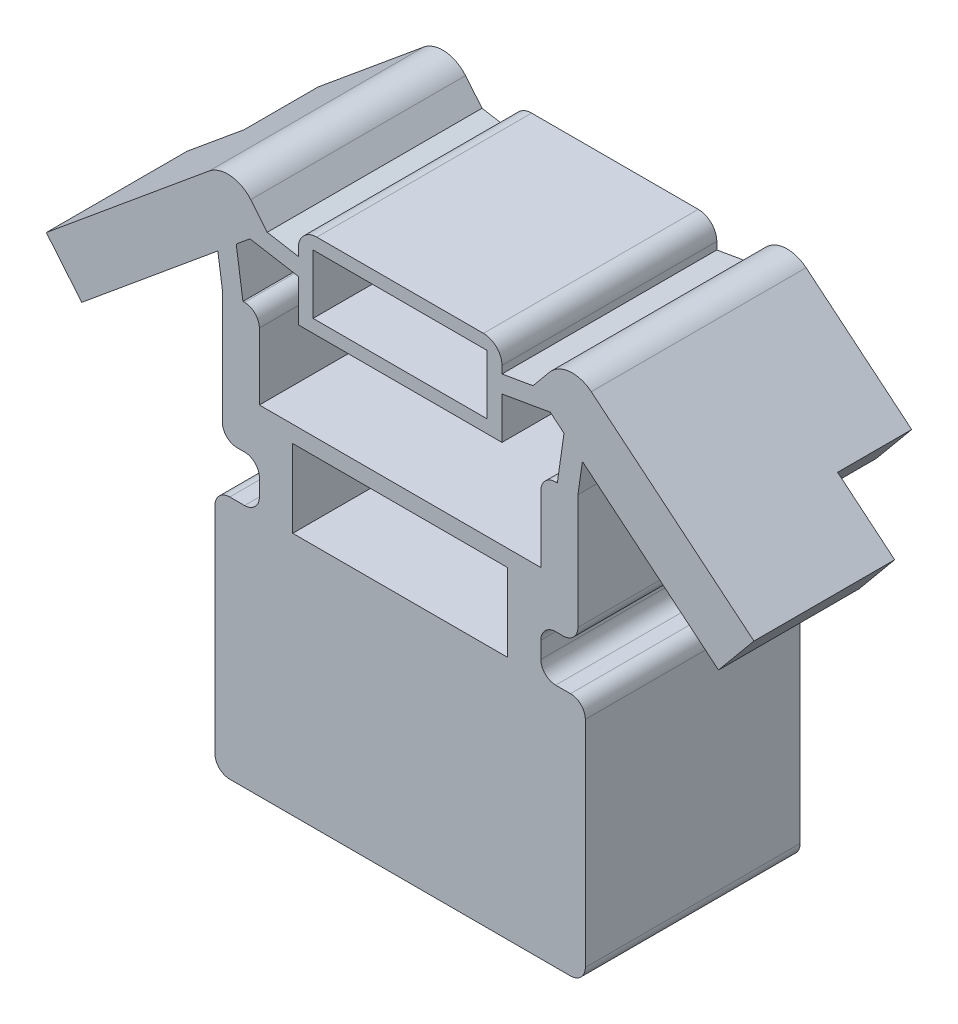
ISO-10303-21;
HEADER;
FILE_DESCRIPTION(('STEP AP214'),'2;1');
FILE_NAME('part.step','',(''),(''),'','','');
FILE_SCHEMA(('AUTOMOTIVE_DESIGN { 1 0 10303 214 1 1 1 1 }'));
ENDSEC;
DATA;
#1=APPLICATION_CONTEXT('core data for automotive mechanical design processes');
#2=APPLICATION_PROTOCOL_DEFINITION('international standard','automotive_design',2000,#1);
#3=PRODUCT_CONTEXT('',#1,'mechanical');
#4=PRODUCT('Part','Part','',(#3));
#5=PRODUCT_RELATED_PRODUCT_CATEGORY('part','',(#4));
#6=PRODUCT_DEFINITION_FORMATION('','',#4);
#7=PRODUCT_DEFINITION_CONTEXT('part definition',#1,'design');
#8=PRODUCT_DEFINITION('design','',#6,#7);
#9=PRODUCT_DEFINITION_SHAPE('','',#8);
#10=(LENGTH_UNIT() NAMED_UNIT(*) SI_UNIT(.MILLI.,.METRE.));
#11=(NAMED_UNIT(*) PLANE_ANGLE_UNIT() SI_UNIT($,.RADIAN.));
#12=(NAMED_UNIT(*) SI_UNIT($,.STERADIAN.) SOLID_ANGLE_UNIT());
#13=UNCERTAINTY_MEASURE_WITH_UNIT(LENGTH_MEASURE(1.E-05),#10,'distance_accuracy_value','');
#14=(GEOMETRIC_REPRESENTATION_CONTEXT(3) GLOBAL_UNCERTAINTY_ASSIGNED_CONTEXT((#13)) GLOBAL_UNIT_ASSIGNED_CONTEXT((#10,
#11,#12)) REPRESENTATION_CONTEXT('',''));
#15=CARTESIAN_POINT('',(0.,0.,0.));
#16=DIRECTION('',(0.,0.,1.));
#17=DIRECTION('',(1.,0.,0.));
#18=AXIS2_PLACEMENT_3D('',#15,#16,#17);
#19=CARTESIAN_POINT('',(4.92123459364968,4.44130979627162,5.8));
#20=DIRECTION('',(0.637453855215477,0.770488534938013,0.));
#21=DIRECTION('',(-0.770488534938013,0.637453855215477,0.));
#22=AXIS2_PLACEMENT_3D('',#19,#20,#21);
#23=PLANE('',#22);
#24=DIRECTION('',(0.,0.,-1.));
#25=VECTOR('',#24,1.);
#26=CARTESIAN_POINT('',(7.05479512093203,2.67613572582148,2.));
#27=LINE('',#26,#25);
#28=CARTESIAN_POINT('',(7.05479512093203,2.67613572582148,2.));
#29=VERTEX_POINT('',#28);
#30=CARTESIAN_POINT('',(7.05479512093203,2.67613572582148,0.));
#31=VERTEX_POINT('',#30);
#32=EDGE_CURVE('E562',#29,#31,#27,.T.);
#33=ORIENTED_EDGE('',*,*,#32,.F.);
#34=DIRECTION('',(0.770488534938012,-0.637453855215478,0.));
#35=VECTOR('',#34,1.);
#36=CARTESIAN_POINT('',(7.05479512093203,2.67613572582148,2.));
#37=LINE('',#36,#35);
#38=CARTESIAN_POINT('',(8.59577219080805,1.40122801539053,2.));
#39=VERTEX_POINT('',#38);
#40=EDGE_CURVE('E566',#29,#39,#37,.T.);
#41=ORIENTED_EDGE('',*,*,#40,.T.);
#42=DIRECTION('',(0.,0.,-1.));
#43=VECTOR('',#42,1.);
#44=CARTESIAN_POINT('',(8.59577219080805,1.40122801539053,11.280658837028));
#45=LINE('',#44,#43);
#46=CARTESIAN_POINT('',(8.59577219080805,1.40122801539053,5.8));
#47=VERTEX_POINT('',#46);
#48=EDGE_CURVE('E631',#47,#39,#45,.T.);
#49=ORIENTED_EDGE('',*,*,#48,.F.);
#50=DIRECTION('',(0.770488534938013,-0.637453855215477,0.));
#51=VECTOR('',#50,1.);
#52=CARTESIAN_POINT('',(4.92123459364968,4.44130979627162,5.8));
#53=LINE('',#52,#51);
#54=CARTESIAN_POINT('',(4.92123459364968,4.44130979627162,5.8));
#55=VERTEX_POINT('',#54);
#56=EDGE_CURVE('E868',#55,#47,#53,.T.);
#57=ORIENTED_EDGE('',*,*,#56,.F.);
#58=DIRECTION('',(0.,0.,-1.));
#59=VECTOR('',#58,1.);
#60=CARTESIAN_POINT('',(4.92123459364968,4.44130979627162,5.8));
#61=LINE('',#60,#59);
#62=CARTESIAN_POINT('',(4.92123459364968,4.44130979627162,0.));
#63=VERTEX_POINT('',#62);
#64=EDGE_CURVE('E957',#55,#63,#61,.T.);
#65=ORIENTED_EDGE('',*,*,#64,.T.);
#66=DIRECTION('',(0.770488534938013,-0.637453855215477,0.));
#67=VECTOR('',#66,1.);
#68=CARTESIAN_POINT('',(4.92123459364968,4.44130979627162,0.));
#69=LINE('',#68,#67);
#70=EDGE_CURVE('E579',#63,#31,#69,.T.);
#71=ORIENTED_EDGE('',*,*,#70,.T.);
#72=EDGE_LOOP('',(#33,#41,#49,#57,#65,#71));
#73=FACE_BOUND('',#72,.T.);
#74=ADVANCED_FACE('F38',(#73),#23,.F.);
#75=CARTESIAN_POINT('',(4.54377749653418,6.70041087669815,5.8));
#76=DIRECTION('',(-0.637453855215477,-0.770488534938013,0.));
#77=DIRECTION('',(0.770488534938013,-0.637453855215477,0.));
#78=AXIS2_PLACEMENT_3D('',#75,#76,#77);
#79=PLANE('',#78);
#80=DIRECTION('',(0.,0.,-1.));
#81=VECTOR('',#80,1.);
#82=CARTESIAN_POINT('',(8.01097590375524,3.8318685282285,2.));
#83=LINE('',#82,#81);
#84=CARTESIAN_POINT('',(8.01097590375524,3.8318685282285,2.));
#85=VERTEX_POINT('',#84);
#86=CARTESIAN_POINT('',(8.01097590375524,3.8318685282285,0.));
#87=VERTEX_POINT('',#86);
#88=EDGE_CURVE('E565',#85,#87,#83,.T.);
#89=ORIENTED_EDGE('',*,*,#88,.T.);
#90=DIRECTION('',(-0.770488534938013,0.637453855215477,0.));
#91=VECTOR('',#90,1.);
#92=CARTESIAN_POINT('',(4.54377749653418,6.70041087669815,0.));
#93=LINE('',#92,#91);
#94=CARTESIAN_POINT('',(5.16016832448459,6.19044779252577,0.));
#95=VERTEX_POINT('',#94);
#96=EDGE_CURVE('E911',#87,#95,#93,.T.);
#97=ORIENTED_EDGE('',*,*,#96,.T.);
#98=DIRECTION('',(0.,0.,-1.));
#99=VECTOR('',#98,1.);
#100=CARTESIAN_POINT('',(5.16016832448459,6.19044779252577,5.8));
#101=LINE('',#100,#99);
#102=CARTESIAN_POINT('',(5.16016832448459,6.19044779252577,5.8));
#103=VERTEX_POINT('',#102);
#104=EDGE_CURVE('E1023',#95,#103,#101,.F.);
#105=ORIENTED_EDGE('',*,*,#104,.T.);
#106=DIRECTION('',(-0.770488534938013,0.637453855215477,0.));
#107=VECTOR('',#106,1.);
#108=CARTESIAN_POINT('',(4.54377749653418,6.70041087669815,5.8));
#109=LINE('',#108,#107);
#110=CARTESIAN_POINT('',(9.55195297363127,2.55696081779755,5.8));
#111=VERTEX_POINT('',#110);
#112=EDGE_CURVE('E870',#111,#103,#109,.T.);
#113=ORIENTED_EDGE('',*,*,#112,.F.);
#114=DIRECTION('',(0.,0.,-1.));
#115=VECTOR('',#114,1.);
#116=CARTESIAN_POINT('',(9.55195297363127,2.55696081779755,11.280658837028));
#117=LINE('',#116,#115);
#118=CARTESIAN_POINT('',(9.55195297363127,2.55696081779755,2.));
#119=VERTEX_POINT('',#118);
#120=EDGE_CURVE('E621',#111,#119,#117,.T.);
#121=ORIENTED_EDGE('',*,*,#120,.T.);
#122=DIRECTION('',(-0.770488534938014,0.637453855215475,0.));
#123=VECTOR('',#122,1.);
#124=CARTESIAN_POINT('',(9.55195297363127,2.55696081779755,2.));
#125=LINE('',#124,#123);
#126=EDGE_CURVE('E53',#119,#85,#125,.T.);
#127=ORIENTED_EDGE('',*,*,#126,.T.);
#128=EDGE_LOOP('',(#89,#97,#105,#113,#121,#127));
#129=FACE_BOUND('',#128,.T.);
#130=ADVANCED_FACE('F1268',(#129),#79,.F.);
#131=CARTESIAN_POINT('',(0.,0.,0.));
#132=DIRECTION('',(0.,0.,-1.));
#133=DIRECTION('',(-1.,0.,0.));
#134=AXIS2_PLACEMENT_3D('',#131,#132,#133);
#135=PLANE('',#134);
#136=DIRECTION('',(0.,1.,0.));
#137=VECTOR('',#136,1.);
#138=CARTESIAN_POINT('',(-2.5,-1.75,0.));
#139=LINE('',#138,#137);
#140=CARTESIAN_POINT('',(-2.5,-2.75,0.));
#141=VERTEX_POINT('',#140);
#142=CARTESIAN_POINT('',(-2.5,-2.15,0.));
#143=VERTEX_POINT('',#142);
#144=EDGE_CURVE('E604',#141,#143,#139,.T.);
#145=ORIENTED_EDGE('',*,*,#144,.F.);
#146=CARTESIAN_POINT('',(-2.9,-2.75,0.));
#147=DIRECTION('',(0.,0.,-1.));
#148=DIRECTION('',(-1.,0.,0.));
#149=AXIS2_PLACEMENT_3D('',#146,#147,#148);
#150=CIRCLE('',#149,0.4);
#151=CARTESIAN_POINT('',(-2.9,-3.15,0.));
#152=VERTEX_POINT('',#151);
#153=EDGE_CURVE('E1174',#141,#152,#150,.T.);
#154=ORIENTED_EDGE('',*,*,#153,.T.);
#155=DIRECTION('',(-1.,0.,0.));
#156=VECTOR('',#155,1.);
#157=CARTESIAN_POINT('',(-4.4,-3.15,0.));
#158=LINE('',#157,#156);
#159=CARTESIAN_POINT('',(-4.3,-3.15,0.));
#160=VERTEX_POINT('',#159);
#161=EDGE_CURVE('E651',#152,#160,#158,.T.);
#162=ORIENTED_EDGE('',*,*,#161,.T.);
#163=CARTESIAN_POINT('',(-4.3,-3.25,0.));
#164=DIRECTION('',(0.,0.,-1.));
#165=DIRECTION('',(-1.,0.,0.));
#166=AXIS2_PLACEMENT_3D('',#163,#164,#165);
#167=CIRCLE('',#166,0.1);
#168=CARTESIAN_POINT('',(-4.4,-3.25,0.));
#169=VERTEX_POINT('',#168);
#170=EDGE_CURVE('E1149',#160,#169,#167,.F.);
#171=ORIENTED_EDGE('',*,*,#170,.T.);
#172=DIRECTION('',(0.,-1.,0.));
#173=VECTOR('',#172,1.);
#174=CARTESIAN_POINT('',(-4.4,-3.15,0.));
#175=LINE('',#174,#173);
#176=CARTESIAN_POINT('',(-4.4,-7.05,0.));
#177=VERTEX_POINT('',#176);
#178=EDGE_CURVE('E668',#169,#177,#175,.T.);
#179=ORIENTED_EDGE('',*,*,#178,.T.);
#180=CARTESIAN_POINT('',(-4.3,-7.05,0.));
#181=DIRECTION('',(0.,0.,-1.));
#182=DIRECTION('',(-1.,0.,0.));
#183=AXIS2_PLACEMENT_3D('',#180,#181,#182);
#184=CIRCLE('',#183,0.1);
#185=CARTESIAN_POINT('',(-4.3,-7.15,0.));
#186=VERTEX_POINT('',#185);
#187=EDGE_CURVE('E1145',#177,#186,#184,.F.);
#188=ORIENTED_EDGE('',*,*,#187,.T.);
#189=DIRECTION('',(1.,0.,0.));
#190=VECTOR('',#189,1.);
#191=CARTESIAN_POINT('',(-4.4,-7.15,0.));
#192=LINE('',#191,#190);
#193=CARTESIAN_POINT('',(4.3,-7.15,0.));
#194=VERTEX_POINT('',#193);
#195=EDGE_CURVE('E671',#186,#194,#192,.T.);
#196=ORIENTED_EDGE('',*,*,#195,.T.);
#197=CARTESIAN_POINT('',(4.3,-7.05,0.));
#198=DIRECTION('',(0.,0.,-1.));
#199=DIRECTION('',(-1.,0.,0.));
#200=AXIS2_PLACEMENT_3D('',#197,#198,#199);
#201=CIRCLE('',#200,0.1);
#202=CARTESIAN_POINT('',(4.4,-7.05,0.));
#203=VERTEX_POINT('',#202);
#204=EDGE_CURVE('E1147',#194,#203,#201,.F.);
#205=ORIENTED_EDGE('',*,*,#204,.T.);
#206=DIRECTION('',(0.,1.,0.));
#207=VECTOR('',#206,1.);
#208=CARTESIAN_POINT('',(4.4,-3.15,0.));
#209=LINE('',#208,#207);
#210=CARTESIAN_POINT('',(4.4,-3.25,0.));
#211=VERTEX_POINT('',#210);
#212=EDGE_CURVE('E675',#203,#211,#209,.T.);
#213=ORIENTED_EDGE('',*,*,#212,.T.);
#214=CARTESIAN_POINT('',(4.3,-3.25,0.));
#215=DIRECTION('',(0.,0.,-1.));
#216=DIRECTION('',(-1.,0.,0.));
#217=AXIS2_PLACEMENT_3D('',#214,#215,#216);
#218=CIRCLE('',#217,0.1);
#219=CARTESIAN_POINT('',(4.3,-3.15,0.));
#220=VERTEX_POINT('',#219);
#221=EDGE_CURVE('E1151',#211,#220,#218,.F.);
#222=ORIENTED_EDGE('',*,*,#221,.T.);
#223=CARTESIAN_POINT('',(2.9,-3.15,0.));
#224=VERTEX_POINT('',#223);
#225=EDGE_CURVE('E672',#220,#224,#158,.T.);
#226=ORIENTED_EDGE('',*,*,#225,.T.);
#227=CARTESIAN_POINT('',(2.9,-2.75,0.));
#228=DIRECTION('',(0.,0.,-1.));
#229=DIRECTION('',(-1.,0.,0.));
#230=AXIS2_PLACEMENT_3D('',#227,#228,#229);
#231=CIRCLE('',#230,0.4);
#232=CARTESIAN_POINT('',(2.5,-2.75,0.));
#233=VERTEX_POINT('',#232);
#234=EDGE_CURVE('E1172',#224,#233,#231,.T.);
#235=ORIENTED_EDGE('',*,*,#234,.T.);
#236=DIRECTION('',(0.,-1.,0.));
#237=VECTOR('',#236,1.);
#238=CARTESIAN_POINT('',(2.5,-1.75,0.));
#239=LINE('',#238,#237);
#240=CARTESIAN_POINT('',(2.5,-2.15,0.));
#241=VERTEX_POINT('',#240);
#242=EDGE_CURVE('E598',#241,#233,#239,.T.);
#243=ORIENTED_EDGE('',*,*,#242,.F.);
#244=CARTESIAN_POINT('',(2.1,-2.15,0.));
#245=DIRECTION('',(0.,0.,-1.));
#246=DIRECTION('',(-1.,0.,0.));
#247=AXIS2_PLACEMENT_3D('',#244,#245,#246);
#248=CIRCLE('',#247,0.4);
#249=CARTESIAN_POINT('',(2.1,-1.75,0.));
#250=VERTEX_POINT('',#249);
#251=EDGE_CURVE('E1181',#241,#250,#248,.F.);
#252=ORIENTED_EDGE('',*,*,#251,.T.);
#253=DIRECTION('',(1.,0.,0.));
#254=VECTOR('',#253,1.);
#255=CARTESIAN_POINT('',(2.5,-1.75,0.));
#256=LINE('',#255,#254);
#257=CARTESIAN_POINT('',(-2.1,-1.75,0.));
#258=VERTEX_POINT('',#257);
#259=EDGE_CURVE('E600',#258,#250,#256,.T.);
#260=ORIENTED_EDGE('',*,*,#259,.F.);
#261=CARTESIAN_POINT('',(-2.1,-2.15,0.));
#262=DIRECTION('',(0.,0.,-1.));
#263=DIRECTION('',(-1.,0.,0.));
#264=AXIS2_PLACEMENT_3D('',#261,#262,#263);
#265=CIRCLE('',#264,0.4);
#266=EDGE_CURVE('E1183',#258,#143,#265,.F.);
#267=ORIENTED_EDGE('',*,*,#266,.T.);
#268=EDGE_LOOP('',(#145,#154,#162,#171,#179,#188,#196,#205,#213,#222,#226,#235,#243,#252,#260,#267));
#269=FACE_BOUND('',#268,.T.);
#270=DIRECTION('',(0.,-1.,0.));
#271=VECTOR('',#270,1.);
#272=CARTESIAN_POINT('',(-2.9,-1.05,0.));
#273=LINE('',#272,#271);
#274=CARTESIAN_POINT('',(-2.9,0.95,0.));
#275=VERTEX_POINT('',#274);
#276=CARTESIAN_POINT('',(-2.9,-1.15,0.));
#277=VERTEX_POINT('',#276);
#278=EDGE_CURVE('E745',#275,#277,#273,.T.);
#279=ORIENTED_EDGE('',*,*,#278,.T.);
#280=DIRECTION('',(1.,0.,0.));
#281=VECTOR('',#280,1.);
#282=CARTESIAN_POINT('',(-2.9,-1.15,0.));
#283=LINE('',#282,#281);
#284=CARTESIAN_POINT('',(2.9,-1.15,0.));
#285=VERTEX_POINT('',#284);
#286=EDGE_CURVE('E691',#277,#285,#283,.T.);
#287=ORIENTED_EDGE('',*,*,#286,.T.);
#288=DIRECTION('',(0.,1.,0.));
#289=VECTOR('',#288,1.);
#290=CARTESIAN_POINT('',(2.9,-1.05,0.));
#291=LINE('',#290,#289);
#292=CARTESIAN_POINT('',(2.9,0.95,0.));
#293=VERTEX_POINT('',#292);
#294=EDGE_CURVE('E742',#285,#293,#291,.T.);
#295=ORIENTED_EDGE('',*,*,#294,.T.);
#296=DIRECTION('',(1.,0.,0.));
#297=VECTOR('',#296,1.);
#298=CARTESIAN_POINT('',(-2.9,0.95,0.));
#299=LINE('',#298,#297);
#300=EDGE_CURVE('E705',#275,#293,#299,.T.);
#301=ORIENTED_EDGE('',*,*,#300,.F.);
#302=EDGE_LOOP('',(#279,#287,#295,#301));
#303=FACE_BOUND('',#302,.T.);
#304=DIRECTION('',(0.,1.,0.));
#305=VECTOR('',#304,1.);
#306=CARTESIAN_POINT('',(2.35,5.75,0.));
#307=LINE('',#306,#305);
#308=CARTESIAN_POINT('',(2.35,4.15,0.));
#309=VERTEX_POINT('',#308);
#310=CARTESIAN_POINT('',(2.35,5.75,0.));
#311=VERTEX_POINT('',#310);
#312=EDGE_CURVE('E756',#309,#311,#307,.T.);
#313=ORIENTED_EDGE('',*,*,#312,.T.);
#314=DIRECTION('',(1.,0.,0.));
#315=VECTOR('',#314,1.);
#316=CARTESIAN_POINT('',(2.35,5.75,0.));
#317=LINE('',#316,#315);
#318=CARTESIAN_POINT('',(-2.35,5.75,0.));
#319=VERTEX_POINT('',#318);
#320=EDGE_CURVE('E716',#319,#311,#317,.T.);
#321=ORIENTED_EDGE('',*,*,#320,.F.);
#322=DIRECTION('',(0.,1.,0.));
#323=VECTOR('',#322,1.);
#324=CARTESIAN_POINT('',(-2.35,0.,0.));
#325=LINE('',#324,#323);
#326=CARTESIAN_POINT('',(-2.35,4.15,0.));
#327=VERTEX_POINT('',#326);
#328=EDGE_CURVE('E968',#327,#319,#325,.T.);
#329=ORIENTED_EDGE('',*,*,#328,.F.);
#330=DIRECTION('',(1.,0.,0.));
#331=VECTOR('',#330,1.);
#332=CARTESIAN_POINT('',(-2.35,4.15,0.));
#333=LINE('',#332,#331);
#334=EDGE_CURVE('E753',#327,#309,#333,.T.);
#335=ORIENTED_EDGE('',*,*,#334,.T.);
#336=EDGE_LOOP('',(#313,#321,#329,#335));
#337=FACE_BOUND('',#336,.T.);
#338=DIRECTION('',(1.,0.,0.));
#339=VECTOR('',#338,1.);
#340=CARTESIAN_POINT('',(-3.8,3.6,0.));
#341=LINE('',#340,#339);
#342=CARTESIAN_POINT('',(-4.24431884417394,3.6,0.));
#343=VERTEX_POINT('',#342);
#344=CARTESIAN_POINT('',(-4.2,3.6,0.));
#345=VERTEX_POINT('',#344);
#346=EDGE_CURVE('E803',#343,#345,#341,.T.);
#347=ORIENTED_EDGE('',*,*,#346,.T.);
#348=CARTESIAN_POINT('',(-4.2,3.2,0.));
#349=DIRECTION('',(0.,0.,-1.));
#350=DIRECTION('',(-1.,0.,0.));
#351=AXIS2_PLACEMENT_3D('',#348,#349,#350);
#352=CIRCLE('',#351,0.4);
#353=CARTESIAN_POINT('',(-3.8,3.2,0.));
#354=VERTEX_POINT('',#353);
#355=EDGE_CURVE('E993',#345,#354,#352,.T.);
#356=ORIENTED_EDGE('',*,*,#355,.T.);
#357=DIRECTION('',(0.,-1.,0.));
#358=VECTOR('',#357,1.);
#359=CARTESIAN_POINT('',(-3.8,1.4,0.));
#360=LINE('',#359,#358);
#361=CARTESIAN_POINT('',(-3.8,1.4,0.));
#362=VERTEX_POINT('',#361);
#363=EDGE_CURVE('E748',#354,#362,#360,.T.);
#364=ORIENTED_EDGE('',*,*,#363,.T.);
#365=DIRECTION('',(-1.,0.,0.));
#366=VECTOR('',#365,1.);
#367=CARTESIAN_POINT('',(-3.8,1.4,0.));
#368=LINE('',#367,#366);
#369=CARTESIAN_POINT('',(3.8,1.4,0.));
#370=VERTEX_POINT('',#369);
#371=EDGE_CURVE('E894',#370,#362,#368,.T.);
#372=ORIENTED_EDGE('',*,*,#371,.F.);
#373=DIRECTION('',(0.,-1.,0.));
#374=VECTOR('',#373,1.);
#375=CARTESIAN_POINT('',(3.8,1.4,0.));
#376=LINE('',#375,#374);
#377=CARTESIAN_POINT('',(3.8,3.2,0.));
#378=VERTEX_POINT('',#377);
#379=EDGE_CURVE('E848',#378,#370,#376,.T.);
#380=ORIENTED_EDGE('',*,*,#379,.F.);
#381=CARTESIAN_POINT('',(4.2,3.2,0.));
#382=DIRECTION('',(0.,0.,-1.));
#383=DIRECTION('',(-1.,0.,0.));
#384=AXIS2_PLACEMENT_3D('',#381,#382,#383);
#385=CIRCLE('',#384,0.4);
#386=CARTESIAN_POINT('',(4.2,3.6,0.));
#387=VERTEX_POINT('',#386);
#388=EDGE_CURVE('E991',#378,#387,#385,.T.);
#389=ORIENTED_EDGE('',*,*,#388,.T.);
#390=DIRECTION('',(-1.,0.,0.));
#391=VECTOR('',#390,1.);
#392=CARTESIAN_POINT('',(3.8,3.6,0.));
#393=LINE('',#392,#391);
#394=CARTESIAN_POINT('',(4.24431884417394,3.6,0.));
#395=VERTEX_POINT('',#394);
#396=EDGE_CURVE('E852',#395,#387,#393,.T.);
#397=ORIENTED_EDGE('',*,*,#396,.F.);
#398=DIRECTION('',(-0.142628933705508,-0.98977623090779,0.));
#399=VECTOR('',#398,1.);
#400=CARTESIAN_POINT('',(4.24431884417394,3.6,0.));
#401=LINE('',#400,#399);
#402=CARTESIAN_POINT('',(4.42474543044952,4.85207376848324,0.));
#403=VERTEX_POINT('',#402);
#404=EDGE_CURVE('E927',#403,#395,#401,.T.);
#405=ORIENTED_EDGE('',*,*,#404,.F.);
#406=DIRECTION('',(0.770488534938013,-0.637453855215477,0.));
#407=VECTOR('',#406,1.);
#408=CARTESIAN_POINT('',(4.05437709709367,5.15849328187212,0.));
#409=LINE('',#408,#407);
#410=CARTESIAN_POINT('',(4.05437709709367,5.15849328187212,0.));
#411=VERTEX_POINT('',#410);
#412=EDGE_CURVE('E925',#411,#403,#409,.T.);
#413=ORIENTED_EDGE('',*,*,#412,.F.);
#414=DIRECTION('',(0.985407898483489,0.170209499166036,0.));
#415=VECTOR('',#414,1.);
#416=CARTESIAN_POINT('',(2.75,4.93318823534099,0.));
#417=LINE('',#416,#415);
#418=CARTESIAN_POINT('',(2.75,4.93318823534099,0.));
#419=VERTEX_POINT('',#418);
#420=EDGE_CURVE('E923',#419,#411,#417,.T.);
#421=ORIENTED_EDGE('',*,*,#420,.F.);
#422=DIRECTION('',(0.,1.,0.));
#423=VECTOR('',#422,1.);
#424=CARTESIAN_POINT('',(2.75,4.93318823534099,0.));
#425=LINE('',#424,#423);
#426=CARTESIAN_POINT('',(2.75,3.8,0.));
#427=VERTEX_POINT('',#426);
#428=EDGE_CURVE('E921',#427,#419,#425,.T.);
#429=ORIENTED_EDGE('',*,*,#428,.F.);
#430=DIRECTION('',(1.,0.,0.));
#431=VECTOR('',#430,1.);
#432=CARTESIAN_POINT('',(-2.75,3.8,0.));
#433=LINE('',#432,#431);
#434=CARTESIAN_POINT('',(-2.75,3.8,0.));
#435=VERTEX_POINT('',#434);
#436=EDGE_CURVE('E919',#435,#427,#433,.T.);
#437=ORIENTED_EDGE('',*,*,#436,.F.);
#438=DIRECTION('',(0.,-1.,0.));
#439=VECTOR('',#438,1.);
#440=CARTESIAN_POINT('',(-2.75,5.4,0.));
#441=LINE('',#440,#439);
#442=CARTESIAN_POINT('',(-2.75,4.93318823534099,0.));
#443=VERTEX_POINT('',#442);
#444=EDGE_CURVE('E917',#443,#435,#441,.T.);
#445=ORIENTED_EDGE('',*,*,#444,.F.);
#446=DIRECTION('',(-0.985407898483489,0.170209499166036,0.));
#447=VECTOR('',#446,1.);
#448=CARTESIAN_POINT('',(-2.75,4.93318823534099,0.));
#449=LINE('',#448,#447);
#450=CARTESIAN_POINT('',(-4.05437709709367,5.15849328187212,0.));
#451=VERTEX_POINT('',#450);
#452=EDGE_CURVE('E812',#443,#451,#449,.T.);
#453=ORIENTED_EDGE('',*,*,#452,.T.);
#454=DIRECTION('',(-0.770488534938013,-0.637453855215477,0.));
#455=VECTOR('',#454,1.);
#456=CARTESIAN_POINT('',(-4.05437709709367,5.15849328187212,0.));
#457=LINE('',#456,#455);
#458=CARTESIAN_POINT('',(-4.42474543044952,4.85207376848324,0.));
#459=VERTEX_POINT('',#458);
#460=EDGE_CURVE('E809',#451,#459,#457,.T.);
#461=ORIENTED_EDGE('',*,*,#460,.T.);
#462=DIRECTION('',(0.142628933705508,-0.98977623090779,0.));
#463=VECTOR('',#462,1.);
#464=CARTESIAN_POINT('',(-4.24431884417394,3.6,0.));
#465=LINE('',#464,#463);
#466=EDGE_CURVE('E806',#459,#343,#465,.T.);
#467=ORIENTED_EDGE('',*,*,#466,.T.);
#468=EDGE_LOOP('',(#347,#356,#364,#372,#380,#389,#397,#405,#413,#421,#429,#437,#445,#453,#461,#467));
#469=FACE_BOUND('',#468,.T.);
#470=ORIENTED_EDGE('',*,*,#96,.F.);
#471=DIRECTION('',(-0.637453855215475,-0.770488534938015,0.));
#472=VECTOR('',#471,1.);
#473=CARTESIAN_POINT('',(8.01097590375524,3.8318685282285,0.));
#474=LINE('',#473,#472);
#475=EDGE_CURVE('E574',#87,#31,#474,.T.);
#476=ORIENTED_EDGE('',*,*,#475,.T.);
#477=ORIENTED_EDGE('',*,*,#70,.F.);
#478=DIRECTION('',(0.142628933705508,0.989776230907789,0.));
#479=VECTOR('',#478,1.);
#480=CARTESIAN_POINT('',(4.8,3.6,0.));
#481=LINE('',#480,#479);
#482=CARTESIAN_POINT('',(4.8,3.6,0.));
#483=VERTEX_POINT('',#482);
#484=EDGE_CURVE('E908',#483,#63,#481,.T.);
#485=ORIENTED_EDGE('',*,*,#484,.F.);
#486=DIRECTION('',(0.,1.,0.));
#487=VECTOR('',#486,1.);
#488=CARTESIAN_POINT('',(4.8,3.6,0.));
#489=LINE('',#488,#487);
#490=CARTESIAN_POINT('',(4.8,0.500000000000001,0.));
#491=VERTEX_POINT('',#490);
#492=EDGE_CURVE('E906',#491,#483,#489,.T.);
#493=ORIENTED_EDGE('',*,*,#492,.F.);
#494=CARTESIAN_POINT('',(4.4,0.5,0.));
#495=DIRECTION('',(0.,0.,-1.));
#496=DIRECTION('',(-1.,0.,0.));
#497=AXIS2_PLACEMENT_3D('',#494,#495,#496);
#498=CIRCLE('',#497,0.4);
#499=CARTESIAN_POINT('',(4.4,0.1,0.));
#500=VERTEX_POINT('',#499);
#501=EDGE_CURVE('E1049',#491,#500,#498,.T.);
#502=ORIENTED_EDGE('',*,*,#501,.T.);
#503=DIRECTION('',(1.,0.,0.));
#504=VECTOR('',#503,1.);
#505=CARTESIAN_POINT('',(3.8,0.1,0.));
#506=LINE('',#505,#504);
#507=CARTESIAN_POINT('',(4.2,0.1,0.));
#508=VERTEX_POINT('',#507);
#509=EDGE_CURVE('E903',#508,#500,#506,.T.);
#510=ORIENTED_EDGE('',*,*,#509,.F.);
#511=CARTESIAN_POINT('',(4.2,-0.3,0.));
#512=DIRECTION('',(0.,0.,-1.));
#513=DIRECTION('',(-1.,0.,0.));
#514=AXIS2_PLACEMENT_3D('',#511,#512,#513);
#515=CIRCLE('',#514,0.4);
#516=CARTESIAN_POINT('',(3.8,-0.3,0.));
#517=VERTEX_POINT('',#516);
#518=EDGE_CURVE('E1107',#508,#517,#515,.F.);
#519=ORIENTED_EDGE('',*,*,#518,.T.);
#520=DIRECTION('',(0.,1.,0.));
#521=VECTOR('',#520,1.);
#522=CARTESIAN_POINT('',(3.8,-1.4,0.));
#523=LINE('',#522,#521);
#524=CARTESIAN_POINT('',(3.8,-0.750000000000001,0.));
#525=VERTEX_POINT('',#524);
#526=EDGE_CURVE('E900',#525,#517,#523,.T.);
#527=ORIENTED_EDGE('',*,*,#526,.F.);
#528=CARTESIAN_POINT('',(4.2,-0.750000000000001,0.));
#529=DIRECTION('',(0.,0.,-1.));
#530=DIRECTION('',(-1.,0.,0.));
#531=AXIS2_PLACEMENT_3D('',#528,#529,#530);
#532=CIRCLE('',#531,0.4);
#533=CARTESIAN_POINT('',(4.2,-1.15,0.));
#534=VERTEX_POINT('',#533);
#535=EDGE_CURVE('E1105',#525,#534,#532,.F.);
#536=ORIENTED_EDGE('',*,*,#535,.T.);
#537=DIRECTION('',(-1.,0.,0.));
#538=VECTOR('',#537,1.);
#539=CARTESIAN_POINT('',(5.,-1.15,0.));
#540=LINE('',#539,#538);
#541=CARTESIAN_POINT('',(4.6,-1.15,0.));
#542=VERTEX_POINT('',#541);
#543=EDGE_CURVE('E647',#542,#534,#540,.T.);
#544=ORIENTED_EDGE('',*,*,#543,.F.);
#545=CARTESIAN_POINT('',(4.6,-1.55,0.));
#546=DIRECTION('',(0.,0.,-1.));
#547=DIRECTION('',(-1.,0.,0.));
#548=AXIS2_PLACEMENT_3D('',#545,#546,#547);
#549=CIRCLE('',#548,0.4);
#550=CARTESIAN_POINT('',(5.,-1.55,0.));
#551=VERTEX_POINT('',#550);
#552=EDGE_CURVE('E1051',#542,#551,#549,.T.);
#553=ORIENTED_EDGE('',*,*,#552,.T.);
#554=DIRECTION('',(0.,1.,0.));
#555=VECTOR('',#554,1.);
#556=CARTESIAN_POINT('',(5.,-7.75,0.));
#557=LINE('',#556,#555);
#558=CARTESIAN_POINT('',(5.,-7.35,0.));
#559=VERTEX_POINT('',#558);
#560=EDGE_CURVE('E681',#559,#551,#557,.T.);
#561=ORIENTED_EDGE('',*,*,#560,.F.);
#562=CARTESIAN_POINT('',(4.6,-7.35,0.));
#563=DIRECTION('',(0.,0.,-1.));
#564=DIRECTION('',(-1.,0.,0.));
#565=AXIS2_PLACEMENT_3D('',#562,#563,#564);
#566=CIRCLE('',#565,0.4);
#567=CARTESIAN_POINT('',(4.6,-7.75,0.));
#568=VERTEX_POINT('',#567);
#569=EDGE_CURVE('E1055',#559,#568,#566,.T.);
#570=ORIENTED_EDGE('',*,*,#569,.T.);
#571=DIRECTION('',(1.,0.,0.));
#572=VECTOR('',#571,1.);
#573=CARTESIAN_POINT('',(-5.,-7.75,0.));
#574=LINE('',#573,#572);
#575=CARTESIAN_POINT('',(-4.6,-7.75,0.));
#576=VERTEX_POINT('',#575);
#577=EDGE_CURVE('E684',#576,#568,#574,.T.);
#578=ORIENTED_EDGE('',*,*,#577,.F.);
#579=CARTESIAN_POINT('',(-4.6,-7.35,0.));
#580=DIRECTION('',(0.,0.,-1.));
#581=DIRECTION('',(-1.,0.,0.));
#582=AXIS2_PLACEMENT_3D('',#579,#580,#581);
#583=CIRCLE('',#582,0.4);
#584=CARTESIAN_POINT('',(-5.,-7.35,0.));
#585=VERTEX_POINT('',#584);
#586=EDGE_CURVE('E1057',#576,#585,#583,.T.);
#587=ORIENTED_EDGE('',*,*,#586,.T.);
#588=DIRECTION('',(0.,-1.,0.));
#589=VECTOR('',#588,1.);
#590=CARTESIAN_POINT('',(-5.,-1.15,0.));
#591=LINE('',#590,#589);
#592=CARTESIAN_POINT('',(-5.,-1.55,0.));
#593=VERTEX_POINT('',#592);
#594=EDGE_CURVE('E667',#593,#585,#591,.T.);
#595=ORIENTED_EDGE('',*,*,#594,.F.);
#596=CARTESIAN_POINT('',(-4.6,-1.55,0.));
#597=DIRECTION('',(0.,0.,-1.));
#598=DIRECTION('',(-1.,0.,0.));
#599=AXIS2_PLACEMENT_3D('',#596,#597,#598);
#600=CIRCLE('',#599,0.4);
#601=CARTESIAN_POINT('',(-4.6,-1.15,0.));
#602=VERTEX_POINT('',#601);
#603=EDGE_CURVE('E1053',#593,#602,#600,.T.);
#604=ORIENTED_EDGE('',*,*,#603,.T.);
#605=DIRECTION('',(-1.,0.,0.));
#606=VECTOR('',#605,1.);
#607=CARTESIAN_POINT('',(-5.,-1.15,0.));
#608=LINE('',#607,#606);
#609=CARTESIAN_POINT('',(-4.2,-1.15,0.));
#610=VERTEX_POINT('',#609);
#611=EDGE_CURVE('E664',#610,#602,#608,.T.);
#612=ORIENTED_EDGE('',*,*,#611,.F.);
#613=CARTESIAN_POINT('',(-4.2,-0.75,0.));
#614=DIRECTION('',(0.,0.,-1.));
#615=DIRECTION('',(-1.,0.,0.));
#616=AXIS2_PLACEMENT_3D('',#613,#614,#615);
#617=CIRCLE('',#616,0.4);
#618=CARTESIAN_POINT('',(-3.8,-0.75,0.));
#619=VERTEX_POINT('',#618);
#620=EDGE_CURVE('E1101',#610,#619,#617,.F.);
#621=ORIENTED_EDGE('',*,*,#620,.T.);
#622=DIRECTION('',(0.,-1.,0.));
#623=VECTOR('',#622,1.);
#624=CARTESIAN_POINT('',(-3.8,-1.4,0.));
#625=LINE('',#624,#623);
#626=CARTESIAN_POINT('',(-3.8,-0.3,0.));
#627=VERTEX_POINT('',#626);
#628=EDGE_CURVE('E897',#627,#619,#625,.T.);
#629=ORIENTED_EDGE('',*,*,#628,.F.);
#630=CARTESIAN_POINT('',(-4.2,-0.3,0.));
#631=DIRECTION('',(0.,0.,-1.));
#632=DIRECTION('',(-1.,0.,0.));
#633=AXIS2_PLACEMENT_3D('',#630,#631,#632);
#634=CIRCLE('',#633,0.4);
#635=CARTESIAN_POINT('',(-4.2,0.1,0.));
#636=VERTEX_POINT('',#635);
#637=EDGE_CURVE('E1111',#627,#636,#634,.F.);
#638=ORIENTED_EDGE('',*,*,#637,.T.);
#639=DIRECTION('',(-1.,0.,0.));
#640=VECTOR('',#639,1.);
#641=CARTESIAN_POINT('',(-3.8,0.1,0.));
#642=LINE('',#641,#640);
#643=CARTESIAN_POINT('',(-4.4,0.1,0.));
#644=VERTEX_POINT('',#643);
#645=EDGE_CURVE('E771',#636,#644,#642,.T.);
#646=ORIENTED_EDGE('',*,*,#645,.T.);
#647=CARTESIAN_POINT('',(-4.4,0.5,0.));
#648=DIRECTION('',(0.,0.,-1.));
#649=DIRECTION('',(-1.,0.,0.));
#650=AXIS2_PLACEMENT_3D('',#647,#648,#649);
#651=CIRCLE('',#650,0.4);
#652=CARTESIAN_POINT('',(-4.8,0.500000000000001,0.));
#653=VERTEX_POINT('',#652);
#654=EDGE_CURVE('E1047',#644,#653,#651,.T.);
#655=ORIENTED_EDGE('',*,*,#654,.T.);
#656=DIRECTION('',(0.,1.,0.));
#657=VECTOR('',#656,1.);
#658=CARTESIAN_POINT('',(-4.8,3.6,0.));
#659=LINE('',#658,#657);
#660=CARTESIAN_POINT('',(-4.8,3.6,0.));
#661=VERTEX_POINT('',#660);
#662=EDGE_CURVE('E828',#653,#661,#659,.T.);
#663=ORIENTED_EDGE('',*,*,#662,.T.);
#664=DIRECTION('',(-0.142628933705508,0.989776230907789,0.));
#665=VECTOR('',#664,1.);
#666=CARTESIAN_POINT('',(-4.8,3.6,0.));
#667=LINE('',#666,#665);
#668=CARTESIAN_POINT('',(-4.92123459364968,4.44130979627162,0.));
#669=VERTEX_POINT('',#668);
#670=EDGE_CURVE('E825',#661,#669,#667,.T.);
#671=ORIENTED_EDGE('',*,*,#670,.T.);
#672=DIRECTION('',(-0.770488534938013,-0.637453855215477,0.));
#673=VECTOR('',#672,1.);
#674=CARTESIAN_POINT('',(-4.92123459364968,4.44130979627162,0.));
#675=LINE('',#674,#673);
#676=CARTESIAN_POINT('',(-7.05479512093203,2.67613572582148,0.));
#677=VERTEX_POINT('',#676);
#678=EDGE_CURVE('E822',#669,#677,#675,.T.);
#679=ORIENTED_EDGE('',*,*,#678,.T.);
#680=DIRECTION('',(0.637453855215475,-0.770488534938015,0.));
#681=VECTOR('',#680,1.);
#682=CARTESIAN_POINT('',(-8.01097590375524,3.8318685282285,0.));
#683=LINE('',#682,#681);
#684=CARTESIAN_POINT('',(-8.01097590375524,3.8318685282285,0.));
#685=VERTEX_POINT('',#684);
#686=EDGE_CURVE('E581',#685,#677,#683,.T.);
#687=ORIENTED_EDGE('',*,*,#686,.F.);
#688=DIRECTION('',(0.770488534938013,0.637453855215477,0.));
#689=VECTOR('',#688,1.);
#690=CARTESIAN_POINT('',(-4.54377749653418,6.70041087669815,0.));
#691=LINE('',#690,#689);
#692=CARTESIAN_POINT('',(-5.16016832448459,6.19044779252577,0.));
#693=VERTEX_POINT('',#692);
#694=EDGE_CURVE('E820',#685,#693,#691,.T.);
#695=ORIENTED_EDGE('',*,*,#694,.T.);
#696=CARTESIAN_POINT('',(-4.65020524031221,5.57405696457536,0.));
#697=DIRECTION('',(0.,0.,-1.));
#698=DIRECTION('',(-1.,0.,0.));
#699=AXIS2_PLACEMENT_3D('',#696,#697,#698);
#700=CIRCLE('',#699,0.8);
#701=CARTESIAN_POINT('',(-4.0338144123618,6.08402004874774,0.));
#702=VERTEX_POINT('',#701);
#703=EDGE_CURVE('E1012',#693,#702,#700,.T.);
#704=ORIENTED_EDGE('',*,*,#703,.T.);
#705=DIRECTION('',(0.637453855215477,-0.770488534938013,0.));
#706=VECTOR('',#705,1.);
#707=CARTESIAN_POINT('',(-4.54377749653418,6.70041087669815,0.));
#708=LINE('',#707,#706);
#709=CARTESIAN_POINT('',(-3.58759671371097,5.54467807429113,0.));
#710=VERTEX_POINT('',#709);
#711=EDGE_CURVE('E818',#702,#710,#708,.T.);
#712=ORIENTED_EDGE('',*,*,#711,.T.);
#713=DIRECTION('',(0.98540789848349,-0.170209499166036,0.));
#714=VECTOR('',#713,1.);
#715=CARTESIAN_POINT('',(-2.75,5.4,0.));
#716=LINE('',#715,#714);
#717=CARTESIAN_POINT('',(-2.75,5.4,0.));
#718=VERTEX_POINT('',#717);
#719=EDGE_CURVE('E815',#710,#718,#716,.T.);
#720=ORIENTED_EDGE('',*,*,#719,.T.);
#721=DIRECTION('',(0.,-1.,0.));
#722=VECTOR('',#721,1.);
#723=CARTESIAN_POINT('',(-2.75,5.4,0.));
#724=LINE('',#723,#722);
#725=CARTESIAN_POINT('',(-2.75,5.6,0.));
#726=VERTEX_POINT('',#725);
#727=EDGE_CURVE('E728',#726,#718,#724,.T.);
#728=ORIENTED_EDGE('',*,*,#727,.F.);
#729=CARTESIAN_POINT('',(-2.25,5.6,0.));
#730=DIRECTION('',(0.,0.,-1.));
#731=DIRECTION('',(-1.,0.,0.));
#732=AXIS2_PLACEMENT_3D('',#729,#730,#731);
#733=CIRCLE('',#732,0.5);
#734=CARTESIAN_POINT('',(-2.25,6.1,0.));
#735=VERTEX_POINT('',#734);
#736=EDGE_CURVE('E983',#726,#735,#733,.T.);
#737=ORIENTED_EDGE('',*,*,#736,.T.);
#738=DIRECTION('',(-1.,0.,0.));
#739=VECTOR('',#738,1.);
#740=CARTESIAN_POINT('',(-2.75,6.1,0.));
#741=LINE('',#740,#739);
#742=CARTESIAN_POINT('',(2.25,6.1,0.));
#743=VERTEX_POINT('',#742);
#744=EDGE_CURVE('E731',#743,#735,#741,.T.);
#745=ORIENTED_EDGE('',*,*,#744,.F.);
#746=CARTESIAN_POINT('',(2.25,5.6,0.));
#747=DIRECTION('',(0.,0.,-1.));
#748=DIRECTION('',(-1.,0.,0.));
#749=AXIS2_PLACEMENT_3D('',#746,#747,#748);
#750=CIRCLE('',#749,0.5);
#751=CARTESIAN_POINT('',(2.75,5.6,0.));
#752=VERTEX_POINT('',#751);
#753=EDGE_CURVE('E981',#743,#752,#750,.T.);
#754=ORIENTED_EDGE('',*,*,#753,.T.);
#755=DIRECTION('',(0.,1.,0.));
#756=VECTOR('',#755,1.);
#757=CARTESIAN_POINT('',(2.75,6.1,0.));
#758=LINE('',#757,#756);
#759=CARTESIAN_POINT('',(2.75,5.4,0.));
#760=VERTEX_POINT('',#759);
#761=EDGE_CURVE('E734',#760,#752,#758,.T.);
#762=ORIENTED_EDGE('',*,*,#761,.F.);
#763=DIRECTION('',(-0.98540789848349,-0.170209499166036,0.));
#764=VECTOR('',#763,1.);
#765=CARTESIAN_POINT('',(2.75,5.4,0.));
#766=LINE('',#765,#764);
#767=CARTESIAN_POINT('',(3.58759671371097,5.54467807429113,0.));
#768=VERTEX_POINT('',#767);
#769=EDGE_CURVE('E915',#768,#760,#766,.T.);
#770=ORIENTED_EDGE('',*,*,#769,.F.);
#771=DIRECTION('',(-0.637453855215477,-0.770488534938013,0.));
#772=VECTOR('',#771,1.);
#773=CARTESIAN_POINT('',(4.54377749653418,6.70041087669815,0.));
#774=LINE('',#773,#772);
#775=CARTESIAN_POINT('',(4.0338144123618,6.08402004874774,0.));
#776=VERTEX_POINT('',#775);
#777=EDGE_CURVE('E913',#776,#768,#774,.T.);
#778=ORIENTED_EDGE('',*,*,#777,.F.);
#779=CARTESIAN_POINT('',(4.65020524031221,5.57405696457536,0.));
#780=DIRECTION('',(0.,0.,-1.));
#781=DIRECTION('',(-1.,0.,0.));
#782=AXIS2_PLACEMENT_3D('',#779,#780,#781);
#783=CIRCLE('',#782,0.8);
#784=EDGE_CURVE('E1009',#776,#95,#783,.T.);
#785=ORIENTED_EDGE('',*,*,#784,.T.);
#786=EDGE_LOOP('',(#470,#476,#477,#485,#493,#502,#510,#519,#527,#536,#544,#553,#561,#570,#578,
#587,#595,#604,#612,#621,#629,#638,#646,#655,#663,#671,#679,#687,#695,#704,#712,#720,#728,#737,
#745,#754,#762,#770,#778,#785));
#787=FACE_BOUND('',#786,.T.);
#788=ADVANCED_FACE('F1200',(#269,#303,#337,#469,#787),#135,.T.);
#789=CARTESIAN_POINT('',(8.59577219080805,1.40122801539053,11.280658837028));
#790=DIRECTION('',(0.770488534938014,-0.637453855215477,0.));
#791=DIRECTION('',(0.637453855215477,0.770488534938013,0.));
#792=AXIS2_PLACEMENT_3D('',#789,#790,#791);
#793=PLANE('',#792);
#794=ORIENTED_EDGE('',*,*,#48,.T.);
#795=DIRECTION('',(0.637453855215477,0.770488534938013,0.));
#796=VECTOR('',#795,1.);
#797=CARTESIAN_POINT('',(8.59577219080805,1.40122801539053,2.));
#798=LINE('',#797,#796);
#799=EDGE_CURVE('E570',#39,#119,#798,.T.);
#800=ORIENTED_EDGE('',*,*,#799,.T.);
#801=ORIENTED_EDGE('',*,*,#120,.F.);
#802=DIRECTION('',(0.637453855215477,0.770488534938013,0.));
#803=VECTOR('',#802,1.);
#804=CARTESIAN_POINT('',(8.59577219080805,1.40122801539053,5.8));
#805=LINE('',#804,#803);
#806=EDGE_CURVE('E627',#47,#111,#805,.T.);
#807=ORIENTED_EDGE('',*,*,#806,.F.);
#808=EDGE_LOOP('',(#794,#800,#801,#807));
#809=FACE_BOUND('',#808,.T.);
#810=ADVANCED_FACE('F1394',(#809),#793,.T.);
#811=CARTESIAN_POINT('',(-8.59577219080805,1.40122801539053,11.280658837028));
#812=DIRECTION('',(0.770488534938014,0.637453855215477,0.));
#813=DIRECTION('',(-0.637453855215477,0.770488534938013,0.));
#814=AXIS2_PLACEMENT_3D('',#811,#812,#813);
#815=PLANE('',#814);
#816=DIRECTION('',(-0.637453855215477,0.770488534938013,0.));
#817=VECTOR('',#816,1.);
#818=CARTESIAN_POINT('',(-8.59577219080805,1.40122801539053,2.));
#819=LINE('',#818,#817);
#820=CARTESIAN_POINT('',(-8.59577219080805,1.40122801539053,2.));
#821=VERTEX_POINT('',#820);
#822=CARTESIAN_POINT('',(-9.55195297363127,2.55696081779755,2.));
#823=VERTEX_POINT('',#822);
#824=EDGE_CURVE('E587',#821,#823,#819,.T.);
#825=ORIENTED_EDGE('',*,*,#824,.F.);
#826=DIRECTION('',(0.,0.,-1.));
#827=VECTOR('',#826,1.);
#828=CARTESIAN_POINT('',(-8.59577219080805,1.40122801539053,11.280658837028));
#829=LINE('',#828,#827);
#830=CARTESIAN_POINT('',(-8.59577219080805,1.40122801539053,5.8));
#831=VERTEX_POINT('',#830);
#832=EDGE_CURVE('E612',#831,#821,#829,.T.);
#833=ORIENTED_EDGE('',*,*,#832,.F.);
#834=DIRECTION('',(-0.637453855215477,0.770488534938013,0.));
#835=VECTOR('',#834,1.);
#836=CARTESIAN_POINT('',(-8.59577219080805,1.40122801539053,5.8));
#837=LINE('',#836,#835);
#838=CARTESIAN_POINT('',(-9.55195297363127,2.55696081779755,5.8));
#839=VERTEX_POINT('',#838);
#840=EDGE_CURVE('E618',#831,#839,#837,.T.);
#841=ORIENTED_EDGE('',*,*,#840,.T.);
#842=DIRECTION('',(0.,0.,-1.));
#843=VECTOR('',#842,1.);
#844=CARTESIAN_POINT('',(-9.55195297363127,2.55696081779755,11.280658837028));
#845=LINE('',#844,#843);
#846=EDGE_CURVE('E622',#839,#823,#845,.T.);
#847=ORIENTED_EDGE('',*,*,#846,.T.);
#848=EDGE_LOOP('',(#825,#833,#841,#847));
#849=FACE_BOUND('',#848,.T.);
#850=ADVANCED_FACE('F1391',(#849),#815,.F.);
#851=CARTESIAN_POINT('',(-4.4,-3.15,-11.9816526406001));
#852=DIRECTION('',(0.,1.,0.));
#853=DIRECTION('',(0.,0.,1.));
#854=AXIS2_PLACEMENT_3D('',#851,#852,#853);
#855=PLANE('',#854);
#856=ORIENTED_EDGE('',*,*,#161,.F.);
#857=DIRECTION('',(0.,0.,-1.));
#858=VECTOR('',#857,1.);
#859=CARTESIAN_POINT('',(-2.9,-3.15,-11.9816526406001));
#860=LINE('',#859,#858);
#861=CARTESIAN_POINT('',(-2.9,-3.15,5.4));
#862=VERTEX_POINT('',#861);
#863=EDGE_CURVE('E1176',#152,#862,#860,.F.);
#864=ORIENTED_EDGE('',*,*,#863,.T.);
#865=DIRECTION('',(-1.,0.,0.));
#866=VECTOR('',#865,1.);
#867=CARTESIAN_POINT('',(-4.4,-3.15,5.4));
#868=LINE('',#867,#866);
#869=CARTESIAN_POINT('',(-4.3,-3.15,5.4));
#870=VERTEX_POINT('',#869);
#871=EDGE_CURVE('E643',#862,#870,#868,.T.);
#872=ORIENTED_EDGE('',*,*,#871,.T.);
#873=DIRECTION('',(0.,0.,1.));
#874=VECTOR('',#873,1.);
#875=CARTESIAN_POINT('',(-4.3,-3.15,0.));
#876=LINE('',#875,#874);
#877=EDGE_CURVE('E1142',#870,#160,#876,.F.);
#878=ORIENTED_EDGE('',*,*,#877,.T.);
#879=EDGE_LOOP('',(#856,#864,#872,#878));
#880=FACE_BOUND('',#879,.T.);
#881=ADVANCED_FACE('F1203',(#880),#855,.F.);
#882=CARTESIAN_POINT('',(-4.4,-3.15,-11.9816526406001));
#883=DIRECTION('',(-1.,0.,0.));
#884=DIRECTION('',(0.,0.,1.));
#885=AXIS2_PLACEMENT_3D('',#882,#883,#884);
#886=PLANE('',#885);
#887=DIRECTION('',(0.,-1.,0.));
#888=VECTOR('',#887,1.);
#889=CARTESIAN_POINT('',(-4.4,-3.15,5.4));
#890=LINE('',#889,#888);
#891=CARTESIAN_POINT('',(-4.4,-3.25,5.4));
#892=VERTEX_POINT('',#891);
#893=CARTESIAN_POINT('',(-4.4,-7.05,5.4));
#894=VERTEX_POINT('',#893);
#895=EDGE_CURVE('E630',#892,#894,#890,.T.);
#896=ORIENTED_EDGE('',*,*,#895,.T.);
#897=DIRECTION('',(0.,0.,1.));
#898=VECTOR('',#897,1.);
#899=CARTESIAN_POINT('',(-4.4,-7.05,0.));
#900=LINE('',#899,#898);
#901=EDGE_CURVE('E1132',#894,#177,#900,.F.);
#902=ORIENTED_EDGE('',*,*,#901,.T.);
#903=ORIENTED_EDGE('',*,*,#178,.F.);
#904=DIRECTION('',(0.,0.,1.));
#905=VECTOR('',#904,1.);
#906=CARTESIAN_POINT('',(-4.4,-3.25,5.4));
#907=LINE('',#906,#905);
#908=EDGE_CURVE('E1129',#169,#892,#907,.T.);
#909=ORIENTED_EDGE('',*,*,#908,.T.);
#910=EDGE_LOOP('',(#896,#902,#903,#909));
#911=FACE_BOUND('',#910,.T.);
#912=ADVANCED_FACE('F1212',(#911),#886,.F.);
#913=CARTESIAN_POINT('',(4.3,-3.15,5.4));
#914=VERTEX_POINT('',#913);
#915=CARTESIAN_POINT('',(2.9,-3.15,5.4));
#916=VERTEX_POINT('',#915);
#917=EDGE_CURVE('E644',#914,#916,#868,.T.);
#918=ORIENTED_EDGE('',*,*,#917,.T.);
#919=DIRECTION('',(0.,0.,-1.));
#920=VECTOR('',#919,1.);
#921=CARTESIAN_POINT('',(2.9,-3.15,-11.9816526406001));
#922=LINE('',#921,#920);
#923=EDGE_CURVE('E1178',#916,#224,#922,.T.);
#924=ORIENTED_EDGE('',*,*,#923,.T.);
#925=ORIENTED_EDGE('',*,*,#225,.F.);
#926=DIRECTION('',(0.,0.,1.));
#927=VECTOR('',#926,1.);
#928=CARTESIAN_POINT('',(4.3,-3.15,5.4));
#929=LINE('',#928,#927);
#930=EDGE_CURVE('E1139',#220,#914,#929,.T.);
#931=ORIENTED_EDGE('',*,*,#930,.T.);
#932=EDGE_LOOP('',(#918,#924,#925,#931));
#933=FACE_BOUND('',#932,.T.);
#934=ADVANCED_FACE('F1238',(#933),#855,.F.);
#935=CARTESIAN_POINT('',(4.4,-3.15,-11.9816526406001));
#936=DIRECTION('',(1.,0.,0.));
#937=DIRECTION('',(0.,0.,-1.));
#938=AXIS2_PLACEMENT_3D('',#935,#936,#937);
#939=PLANE('',#938);
#940=ORIENTED_EDGE('',*,*,#212,.F.);
#941=DIRECTION('',(0.,0.,1.));
#942=VECTOR('',#941,1.);
#943=CARTESIAN_POINT('',(4.4,-7.05,5.4));
#944=LINE('',#943,#942);
#945=CARTESIAN_POINT('',(4.4,-7.05,5.4));
#946=VERTEX_POINT('',#945);
#947=EDGE_CURVE('E1136',#203,#946,#944,.T.);
#948=ORIENTED_EDGE('',*,*,#947,.T.);
#949=DIRECTION('',(0.,1.,0.));
#950=VECTOR('',#949,1.);
#951=CARTESIAN_POINT('',(4.4,-3.15,5.4));
#952=LINE('',#951,#950);
#953=CARTESIAN_POINT('',(4.4,-3.25,5.4));
#954=VERTEX_POINT('',#953);
#955=EDGE_CURVE('E640',#946,#954,#952,.T.);
#956=ORIENTED_EDGE('',*,*,#955,.T.);
#957=DIRECTION('',(0.,0.,1.));
#958=VECTOR('',#957,1.);
#959=CARTESIAN_POINT('',(4.4,-3.25,0.));
#960=LINE('',#959,#958);
#961=EDGE_CURVE('E1134',#954,#211,#960,.F.);
#962=ORIENTED_EDGE('',*,*,#961,.T.);
#963=EDGE_LOOP('',(#940,#948,#956,#962));
#964=FACE_BOUND('',#963,.T.);
#965=ADVANCED_FACE('F1230',(#964),#939,.F.);
#966=CARTESIAN_POINT('',(-4.4,-7.15,-11.9816526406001));
#967=DIRECTION('',(0.,-1.,0.));
#968=DIRECTION('',(0.,0.,-1.));
#969=AXIS2_PLACEMENT_3D('',#966,#967,#968);
#970=PLANE('',#969);
#971=ORIENTED_EDGE('',*,*,#195,.F.);
#972=DIRECTION('',(0.,0.,1.));
#973=VECTOR('',#972,1.);
#974=CARTESIAN_POINT('',(-4.3,-7.15,5.4));
#975=LINE('',#974,#973);
#976=CARTESIAN_POINT('',(-4.3,-7.15,5.4));
#977=VERTEX_POINT('',#976);
#978=EDGE_CURVE('E1117',#186,#977,#975,.T.);
#979=ORIENTED_EDGE('',*,*,#978,.T.);
#980=DIRECTION('',(1.,0.,0.));
#981=VECTOR('',#980,1.);
#982=CARTESIAN_POINT('',(-4.4,-7.15,5.4));
#983=LINE('',#982,#981);
#984=CARTESIAN_POINT('',(4.3,-7.15,5.4));
#985=VERTEX_POINT('',#984);
#986=EDGE_CURVE('E637',#977,#985,#983,.T.);
#987=ORIENTED_EDGE('',*,*,#986,.T.);
#988=DIRECTION('',(0.,0.,1.));
#989=VECTOR('',#988,1.);
#990=CARTESIAN_POINT('',(4.3,-7.15,0.));
#991=LINE('',#990,#989);
#992=EDGE_CURVE('E1115',#985,#194,#991,.F.);
#993=ORIENTED_EDGE('',*,*,#992,.T.);
#994=EDGE_LOOP('',(#971,#979,#987,#993));
#995=FACE_BOUND('',#994,.T.);
#996=ADVANCED_FACE('F1221',(#995),#970,.F.);
#997=CARTESIAN_POINT('',(3.8,1.4,5.8));
#998=DIRECTION('',(1.,0.,0.));
#999=DIRECTION('',(0.,0.,-1.));
#1000=AXIS2_PLACEMENT_3D('',#997,#998,#999);
#1001=PLANE('',#1000);
#1002=DIRECTION('',(0.,-1.,0.));
#1003=VECTOR('',#1002,1.);
#1004=CARTESIAN_POINT('',(3.8,1.4,5.8));
#1005=LINE('',#1004,#1003);
#1006=CARTESIAN_POINT('',(3.8,3.2,5.8));
#1007=VERTEX_POINT('',#1006);
#1008=CARTESIAN_POINT('',(3.8,1.4,5.8));
#1009=VERTEX_POINT('',#1008);
#1010=EDGE_CURVE('E849',#1007,#1009,#1005,.T.);
#1011=ORIENTED_EDGE('',*,*,#1010,.F.);
#1012=DIRECTION('',(0.,0.,-1.));
#1013=VECTOR('',#1012,1.);
#1014=CARTESIAN_POINT('',(3.8,3.2,5.8));
#1015=LINE('',#1014,#1013);
#1016=EDGE_CURVE('E1001',#1007,#378,#1015,.T.);
#1017=ORIENTED_EDGE('',*,*,#1016,.T.);
#1018=ORIENTED_EDGE('',*,*,#379,.T.);
#1019=DIRECTION('',(0.,0.,-1.));
#1020=VECTOR('',#1019,1.);
#1021=CARTESIAN_POINT('',(3.8,1.4,5.8));
#1022=LINE('',#1021,#1020);
#1023=EDGE_CURVE('E965',#1009,#370,#1022,.T.);
#1024=ORIENTED_EDGE('',*,*,#1023,.F.);
#1025=EDGE_LOOP('',(#1011,#1017,#1018,#1024));
#1026=FACE_BOUND('',#1025,.T.);
#1027=ADVANCED_FACE('F1301',(#1026),#1001,.F.);
#1028=CARTESIAN_POINT('',(-3.8,1.4,5.8));
#1029=DIRECTION('',(0.,-1.,0.));
#1030=DIRECTION('',(1.,0.,0.));
#1031=AXIS2_PLACEMENT_3D('',#1028,#1029,#1030);
#1032=PLANE('',#1031);
#1033=ORIENTED_EDGE('',*,*,#371,.T.);
#1034=DIRECTION('',(0.,0.,-1.));
#1035=VECTOR('',#1034,1.);
#1036=CARTESIAN_POINT('',(-3.8,1.4,5.8));
#1037=LINE('',#1036,#1035);
#1038=CARTESIAN_POINT('',(-3.8,1.4,5.8));
#1039=VERTEX_POINT('',#1038);
#1040=EDGE_CURVE('E962',#1039,#362,#1037,.T.);
#1041=ORIENTED_EDGE('',*,*,#1040,.F.);
#1042=DIRECTION('',(-1.,0.,0.));
#1043=VECTOR('',#1042,1.);
#1044=CARTESIAN_POINT('',(-3.8,1.4,5.8));
#1045=LINE('',#1044,#1043);
#1046=EDGE_CURVE('E851',#1009,#1039,#1045,.T.);
#1047=ORIENTED_EDGE('',*,*,#1046,.F.);
#1048=ORIENTED_EDGE('',*,*,#1023,.T.);
#1049=EDGE_LOOP('',(#1033,#1041,#1047,#1048));
#1050=FACE_BOUND('',#1049,.T.);
#1051=ADVANCED_FACE('F1297',(#1050),#1032,.F.);
#1052=CARTESIAN_POINT('',(-3.8,-1.4,5.8));
#1053=DIRECTION('',(1.,0.,0.));
#1054=DIRECTION('',(0.,0.,-1.));
#1055=AXIS2_PLACEMENT_3D('',#1052,#1053,#1054);
#1056=PLANE('',#1055);
#1057=ORIENTED_EDGE('',*,*,#628,.T.);
#1058=DIRECTION('',(0.,0.,1.));
#1059=VECTOR('',#1058,1.);
#1060=CARTESIAN_POINT('',(-3.8,-0.75,5.8));
#1061=LINE('',#1060,#1059);
#1062=CARTESIAN_POINT('',(-3.8,-0.75,5.8));
#1063=VERTEX_POINT('',#1062);
#1064=EDGE_CURVE('E1072',#619,#1063,#1061,.T.);
#1065=ORIENTED_EDGE('',*,*,#1064,.T.);
#1066=DIRECTION('',(0.,-1.,0.));
#1067=VECTOR('',#1066,1.);
#1068=CARTESIAN_POINT('',(-3.8,-1.4,5.8));
#1069=LINE('',#1068,#1067);
#1070=CARTESIAN_POINT('',(-3.8,-0.3,5.8));
#1071=VERTEX_POINT('',#1070);
#1072=EDGE_CURVE('E855',#1071,#1063,#1069,.T.);
#1073=ORIENTED_EDGE('',*,*,#1072,.F.);
#1074=DIRECTION('',(0.,0.,-1.));
#1075=VECTOR('',#1074,1.);
#1076=CARTESIAN_POINT('',(-3.8,-0.3,5.8));
#1077=LINE('',#1076,#1075);
#1078=EDGE_CURVE('E1069',#1071,#627,#1077,.T.);
#1079=ORIENTED_EDGE('',*,*,#1078,.T.);
#1080=EDGE_LOOP('',(#1057,#1065,#1073,#1079));
#1081=FACE_BOUND('',#1080,.T.);
#1082=ADVANCED_FACE('F1293',(#1081),#1056,.F.);
#1083=CARTESIAN_POINT('',(3.8,-1.4,5.8));
#1084=DIRECTION('',(-1.,0.,0.));
#1085=DIRECTION('',(0.,0.,1.));
#1086=AXIS2_PLACEMENT_3D('',#1083,#1084,#1085);
#1087=PLANE('',#1086);
#1088=DIRECTION('',(0.,1.,0.));
#1089=VECTOR('',#1088,1.);
#1090=CARTESIAN_POINT('',(3.8,-1.4,5.8));
#1091=LINE('',#1090,#1089);
#1092=CARTESIAN_POINT('',(3.8,-0.750000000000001,5.8));
#1093=VERTEX_POINT('',#1092);
#1094=CARTESIAN_POINT('',(3.8,-0.3,5.8));
#1095=VERTEX_POINT('',#1094);
#1096=EDGE_CURVE('E858',#1093,#1095,#1091,.T.);
#1097=ORIENTED_EDGE('',*,*,#1096,.F.);
#1098=DIRECTION('',(0.,0.,1.));
#1099=VECTOR('',#1098,1.);
#1100=CARTESIAN_POINT('',(3.8,-0.750000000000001,5.8));
#1101=LINE('',#1100,#1099);
#1102=EDGE_CURVE('E1082',#1093,#525,#1101,.F.);
#1103=ORIENTED_EDGE('',*,*,#1102,.T.);
#1104=ORIENTED_EDGE('',*,*,#526,.T.);
#1105=DIRECTION('',(0.,0.,-1.));
#1106=VECTOR('',#1105,1.);
#1107=CARTESIAN_POINT('',(3.8,-0.3,5.8));
#1108=LINE('',#1107,#1106);
#1109=EDGE_CURVE('E1080',#517,#1095,#1108,.F.);
#1110=ORIENTED_EDGE('',*,*,#1109,.T.);
#1111=EDGE_LOOP('',(#1097,#1103,#1104,#1110));
#1112=FACE_BOUND('',#1111,.T.);
#1113=ADVANCED_FACE('F1289',(#1112),#1087,.F.);
#1114=CARTESIAN_POINT('',(3.8,0.1,5.8));
#1115=DIRECTION('',(0.,1.,0.));
#1116=DIRECTION('',(0.,0.,1.));
#1117=AXIS2_PLACEMENT_3D('',#1114,#1115,#1116);
#1118=PLANE('',#1117);
#1119=DIRECTION('',(1.,0.,0.));
#1120=VECTOR('',#1119,1.);
#1121=CARTESIAN_POINT('',(3.8,0.1,5.8));
#1122=LINE('',#1121,#1120);
#1123=CARTESIAN_POINT('',(4.2,0.1,5.8));
#1124=VERTEX_POINT('',#1123);
#1125=CARTESIAN_POINT('',(4.4,0.1,5.8));
#1126=VERTEX_POINT('',#1125);
#1127=EDGE_CURVE('E861',#1124,#1126,#1122,.T.);
#1128=ORIENTED_EDGE('',*,*,#1127,.F.);
#1129=DIRECTION('',(0.,0.,-1.));
#1130=VECTOR('',#1129,1.);
#1131=CARTESIAN_POINT('',(4.2,0.1,0.));
#1132=LINE('',#1131,#1130);
#1133=EDGE_CURVE('E1086',#1124,#508,#1132,.T.);
#1134=ORIENTED_EDGE('',*,*,#1133,.T.);
#1135=ORIENTED_EDGE('',*,*,#509,.T.);
#1136=DIRECTION('',(0.,0.,-1.));
#1137=VECTOR('',#1136,1.);
#1138=CARTESIAN_POINT('',(4.4,0.1,5.8));
#1139=LINE('',#1138,#1137);
#1140=EDGE_CURVE('E1084',#500,#1126,#1139,.F.);
#1141=ORIENTED_EDGE('',*,*,#1140,.T.);
#1142=EDGE_LOOP('',(#1128,#1134,#1135,#1141));
#1143=FACE_BOUND('',#1142,.T.);
#1144=ADVANCED_FACE('F1285',(#1143),#1118,.F.);
#1145=CARTESIAN_POINT('',(4.8,3.6,5.8));
#1146=DIRECTION('',(-1.,0.,0.));
#1147=DIRECTION('',(0.,-1.,0.));
#1148=AXIS2_PLACEMENT_3D('',#1145,#1146,#1147);
#1149=PLANE('',#1148);
#1150=DIRECTION('',(0.,1.,0.));
#1151=VECTOR('',#1150,1.);
#1152=CARTESIAN_POINT('',(4.8,3.6,5.8));
#1153=LINE('',#1152,#1151);
#1154=CARTESIAN_POINT('',(4.8,0.500000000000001,5.8));
#1155=VERTEX_POINT('',#1154);
#1156=CARTESIAN_POINT('',(4.8,3.6,5.8));
#1157=VERTEX_POINT('',#1156);
#1158=EDGE_CURVE('E864',#1155,#1157,#1153,.T.);
#1159=ORIENTED_EDGE('',*,*,#1158,.F.);
#1160=DIRECTION('',(0.,0.,-1.));
#1161=VECTOR('',#1160,1.);
#1162=CARTESIAN_POINT('',(4.8,0.5,5.8));
#1163=LINE('',#1162,#1161);
#1164=EDGE_CURVE('E1089',#1155,#491,#1163,.T.);
#1165=ORIENTED_EDGE('',*,*,#1164,.T.);
#1166=ORIENTED_EDGE('',*,*,#492,.T.);
#1167=DIRECTION('',(0.,0.,-1.));
#1168=VECTOR('',#1167,1.);
#1169=CARTESIAN_POINT('',(4.8,3.6,5.8));
#1170=LINE('',#1169,#1168);
#1171=EDGE_CURVE('E959',#1157,#483,#1170,.T.);
#1172=ORIENTED_EDGE('',*,*,#1171,.F.);
#1173=EDGE_LOOP('',(#1159,#1165,#1166,#1172));
#1174=FACE_BOUND('',#1173,.T.);
#1175=ADVANCED_FACE('F1281',(#1174),#1149,.F.);
#1176=CARTESIAN_POINT('',(4.8,3.6,5.8));
#1177=DIRECTION('',(-0.989776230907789,0.142628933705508,0.));
#1178=DIRECTION('',(-0.142628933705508,-0.989776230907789,0.));
#1179=AXIS2_PLACEMENT_3D('',#1176,#1177,#1178);
#1180=PLANE('',#1179);
#1181=ORIENTED_EDGE('',*,*,#484,.T.);
#1182=ORIENTED_EDGE('',*,*,#64,.F.);
#1183=DIRECTION('',(0.142628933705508,0.989776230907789,0.));
#1184=VECTOR('',#1183,1.);
#1185=CARTESIAN_POINT('',(4.8,3.6,5.8));
#1186=LINE('',#1185,#1184);
#1187=EDGE_CURVE('E866',#1157,#55,#1186,.T.);
#1188=ORIENTED_EDGE('',*,*,#1187,.F.);
#1189=ORIENTED_EDGE('',*,*,#1171,.T.);
#1190=EDGE_LOOP('',(#1181,#1182,#1188,#1189));
#1191=FACE_BOUND('',#1190,.T.);
#1192=ADVANCED_FACE('F1277',(#1191),#1180,.F.);
#1193=CARTESIAN_POINT('',(4.54377749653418,6.70041087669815,5.8));
#1194=DIRECTION('',(0.770488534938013,-0.637453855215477,0.));
#1195=DIRECTION('',(0.637453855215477,0.770488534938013,0.));
#1196=AXIS2_PLACEMENT_3D('',#1193,#1194,#1195);
#1197=PLANE('',#1196);
#1198=DIRECTION('',(-0.637453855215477,-0.770488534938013,0.));
#1199=VECTOR('',#1198,1.);
#1200=CARTESIAN_POINT('',(4.54377749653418,6.70041087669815,5.8));
#1201=LINE('',#1200,#1199);
#1202=CARTESIAN_POINT('',(4.0338144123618,6.08402004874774,5.8));
#1203=VERTEX_POINT('',#1202);
#1204=CARTESIAN_POINT('',(3.58759671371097,5.54467807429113,5.8));
#1205=VERTEX_POINT('',#1204);
#1206=EDGE_CURVE('E873',#1203,#1205,#1201,.T.);
#1207=ORIENTED_EDGE('',*,*,#1206,.F.);
#1208=DIRECTION('',(0.,0.,-1.));
#1209=VECTOR('',#1208,1.);
#1210=CARTESIAN_POINT('',(4.0338144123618,6.08402004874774,5.8));
#1211=LINE('',#1210,#1209);
#1212=EDGE_CURVE('E1020',#1203,#776,#1211,.T.);
#1213=ORIENTED_EDGE('',*,*,#1212,.T.);
#1214=ORIENTED_EDGE('',*,*,#777,.T.);
#1215=DIRECTION('',(0.,0.,-1.));
#1216=VECTOR('',#1215,1.);
#1217=CARTESIAN_POINT('',(3.58759671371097,5.54467807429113,5.8));
#1218=LINE('',#1217,#1216);
#1219=EDGE_CURVE('E954',#1205,#768,#1218,.T.);
#1220=ORIENTED_EDGE('',*,*,#1219,.F.);
#1221=EDGE_LOOP('',(#1207,#1213,#1214,#1220));
#1222=FACE_BOUND('',#1221,.T.);
#1223=ADVANCED_FACE('F1280',(#1222),#1197,.F.);
#1224=CARTESIAN_POINT('',(2.75,5.4,5.8));
#1225=DIRECTION('',(0.170209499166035,-0.98540789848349,0.));
#1226=DIRECTION('',(0.98540789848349,0.170209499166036,0.));
#1227=AXIS2_PLACEMENT_3D('',#1224,#1225,#1226);
#1228=PLANE('',#1227);
#1229=ORIENTED_EDGE('',*,*,#769,.T.);
#1230=DIRECTION('',(0.,0.,-1.));
#1231=VECTOR('',#1230,1.);
#1232=CARTESIAN_POINT('',(2.75,5.4,5.8));
#1233=LINE('',#1232,#1231);
#1234=CARTESIAN_POINT('',(2.75,5.4,5.8));
#1235=VERTEX_POINT('',#1234);
#1236=EDGE_CURVE('E951',#1235,#760,#1233,.T.);
#1237=ORIENTED_EDGE('',*,*,#1236,.F.);
#1238=DIRECTION('',(-0.98540789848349,-0.170209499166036,0.));
#1239=VECTOR('',#1238,1.);
#1240=CARTESIAN_POINT('',(2.75,5.4,5.8));
#1241=LINE('',#1240,#1239);
#1242=EDGE_CURVE('E875',#1205,#1235,#1241,.T.);
#1243=ORIENTED_EDGE('',*,*,#1242,.F.);
#1244=ORIENTED_EDGE('',*,*,#1219,.T.);
#1245=EDGE_LOOP('',(#1229,#1237,#1243,#1244));
#1246=FACE_BOUND('',#1245,.T.);
#1247=ADVANCED_FACE('F1550',(#1246),#1228,.F.);
#1248=CARTESIAN_POINT('',(-2.75,5.4,5.8));
#1249=DIRECTION('',(1.,0.,0.));
#1250=DIRECTION('',(0.,0.,-1.));
#1251=AXIS2_PLACEMENT_3D('',#1248,#1249,#1250);
#1252=PLANE('',#1251);
#1253=DIRECTION('',(0.,-1.,0.));
#1254=VECTOR('',#1253,1.);
#1255=CARTESIAN_POINT('',(-2.75,5.4,5.8));
#1256=LINE('',#1255,#1254);
#1257=CARTESIAN_POINT('',(-2.75,4.93318823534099,5.8));
#1258=VERTEX_POINT('',#1257);
#1259=CARTESIAN_POINT('',(-2.75,3.8,5.8));
#1260=VERTEX_POINT('',#1259);
#1261=EDGE_CURVE('E877',#1258,#1260,#1256,.T.);
#1262=ORIENTED_EDGE('',*,*,#1261,.F.);
#1263=DIRECTION('',(0.,0.,-1.));
#1264=VECTOR('',#1263,1.);
#1265=CARTESIAN_POINT('',(-2.75,4.93318823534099,5.8));
#1266=LINE('',#1265,#1264);
#1267=EDGE_CURVE('E839',#1258,#443,#1266,.T.);
#1268=ORIENTED_EDGE('',*,*,#1267,.T.);
#1269=ORIENTED_EDGE('',*,*,#444,.T.);
#1270=DIRECTION('',(0.,0.,-1.));
#1271=VECTOR('',#1270,1.);
#1272=CARTESIAN_POINT('',(-2.75,3.8,5.8));
#1273=LINE('',#1272,#1271);
#1274=EDGE_CURVE('E945',#1260,#435,#1273,.T.);
#1275=ORIENTED_EDGE('',*,*,#1274,.F.);
#1276=EDGE_LOOP('',(#1262,#1268,#1269,#1275));
#1277=FACE_BOUND('',#1276,.T.);
#1278=ADVANCED_FACE('F1546',(#1277),#1252,.F.);
#1279=CARTESIAN_POINT('',(-2.75,3.8,5.8));
#1280=DIRECTION('',(0.,1.,0.));
#1281=DIRECTION('',(0.,0.,1.));
#1282=AXIS2_PLACEMENT_3D('',#1279,#1280,#1281);
#1283=PLANE('',#1282);
#1284=ORIENTED_EDGE('',*,*,#436,.T.);
#1285=DIRECTION('',(0.,0.,-1.));
#1286=VECTOR('',#1285,1.);
#1287=CARTESIAN_POINT('',(2.75,3.8,5.8));
#1288=LINE('',#1287,#1286);
#1289=CARTESIAN_POINT('',(2.75,3.8,5.8));
#1290=VERTEX_POINT('',#1289);
#1291=EDGE_CURVE('E942',#1290,#427,#1288,.T.);
#1292=ORIENTED_EDGE('',*,*,#1291,.F.);
#1293=DIRECTION('',(1.,0.,0.));
#1294=VECTOR('',#1293,1.);
#1295=CARTESIAN_POINT('',(-2.75,3.8,5.8));
#1296=LINE('',#1295,#1294);
#1297=EDGE_CURVE('E879',#1260,#1290,#1296,.T.);
#1298=ORIENTED_EDGE('',*,*,#1297,.F.);
#1299=ORIENTED_EDGE('',*,*,#1274,.T.);
#1300=EDGE_LOOP('',(#1284,#1292,#1298,#1299));
#1301=FACE_BOUND('',#1300,.T.);
#1302=ADVANCED_FACE('F1542',(#1301),#1283,.F.);
#1303=CARTESIAN_POINT('',(2.75,4.93318823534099,5.8));
#1304=DIRECTION('',(-1.,0.,0.));
#1305=DIRECTION('',(0.,0.,1.));
#1306=AXIS2_PLACEMENT_3D('',#1303,#1304,#1305);
#1307=PLANE('',#1306);
#1308=ORIENTED_EDGE('',*,*,#428,.T.);
#1309=DIRECTION('',(0.,0.,-1.));
#1310=VECTOR('',#1309,1.);
#1311=CARTESIAN_POINT('',(2.75,4.93318823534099,5.8));
#1312=LINE('',#1311,#1310);
#1313=CARTESIAN_POINT('',(2.75,4.93318823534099,5.8));
#1314=VERTEX_POINT('',#1313);
#1315=EDGE_CURVE('E939',#1314,#419,#1312,.T.);
#1316=ORIENTED_EDGE('',*,*,#1315,.F.);
#1317=DIRECTION('',(0.,1.,0.));
#1318=VECTOR('',#1317,1.);
#1319=CARTESIAN_POINT('',(2.75,4.93318823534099,5.8));
#1320=LINE('',#1319,#1318);
#1321=EDGE_CURVE('E881',#1290,#1314,#1320,.T.);
#1322=ORIENTED_EDGE('',*,*,#1321,.F.);
#1323=ORIENTED_EDGE('',*,*,#1291,.T.);
#1324=EDGE_LOOP('',(#1308,#1316,#1322,#1323));
#1325=FACE_BOUND('',#1324,.T.);
#1326=ADVANCED_FACE('F1538',(#1325),#1307,.F.);
#1327=CARTESIAN_POINT('',(2.75,4.93318823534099,5.8));
#1328=DIRECTION('',(-0.170209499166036,0.98540789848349,0.));
#1329=DIRECTION('',(-0.98540789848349,-0.170209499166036,0.));
#1330=AXIS2_PLACEMENT_3D('',#1327,#1328,#1329);
#1331=PLANE('',#1330);
#1332=ORIENTED_EDGE('',*,*,#420,.T.);
#1333=DIRECTION('',(0.,0.,-1.));
#1334=VECTOR('',#1333,1.);
#1335=CARTESIAN_POINT('',(4.05437709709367,5.15849328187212,5.8));
#1336=LINE('',#1335,#1334);
#1337=CARTESIAN_POINT('',(4.05437709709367,5.15849328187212,5.8));
#1338=VERTEX_POINT('',#1337);
#1339=EDGE_CURVE('E936',#1338,#411,#1336,.T.);
#1340=ORIENTED_EDGE('',*,*,#1339,.F.);
#1341=DIRECTION('',(0.985407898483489,0.170209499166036,0.));
#1342=VECTOR('',#1341,1.);
#1343=CARTESIAN_POINT('',(2.75,4.93318823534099,5.8));
#1344=LINE('',#1343,#1342);
#1345=EDGE_CURVE('E883',#1314,#1338,#1344,.T.);
#1346=ORIENTED_EDGE('',*,*,#1345,.F.);
#1347=ORIENTED_EDGE('',*,*,#1315,.T.);
#1348=EDGE_LOOP('',(#1332,#1340,#1346,#1347));
#1349=FACE_BOUND('',#1348,.T.);
#1350=ADVANCED_FACE('F1534',(#1349),#1331,.F.);
#1351=CARTESIAN_POINT('',(4.05437709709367,5.15849328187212,5.8));
#1352=DIRECTION('',(0.637453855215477,0.770488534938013,0.));
#1353=DIRECTION('',(-0.770488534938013,0.637453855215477,0.));
#1354=AXIS2_PLACEMENT_3D('',#1351,#1352,#1353);
#1355=PLANE('',#1354);
#1356=ORIENTED_EDGE('',*,*,#412,.T.);
#1357=DIRECTION('',(0.,0.,-1.));
#1358=VECTOR('',#1357,1.);
#1359=CARTESIAN_POINT('',(4.42474543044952,4.85207376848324,5.8));
#1360=LINE('',#1359,#1358);
#1361=CARTESIAN_POINT('',(4.42474543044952,4.85207376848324,5.8));
#1362=VERTEX_POINT('',#1361);
#1363=EDGE_CURVE('E933',#1362,#403,#1360,.T.);
#1364=ORIENTED_EDGE('',*,*,#1363,.F.);
#1365=DIRECTION('',(0.770488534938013,-0.637453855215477,0.));
#1366=VECTOR('',#1365,1.);
#1367=CARTESIAN_POINT('',(4.05437709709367,5.15849328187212,5.8));
#1368=LINE('',#1367,#1366);
#1369=EDGE_CURVE('E885',#1338,#1362,#1368,.T.);
#1370=ORIENTED_EDGE('',*,*,#1369,.F.);
#1371=ORIENTED_EDGE('',*,*,#1339,.T.);
#1372=EDGE_LOOP('',(#1356,#1364,#1370,#1371));
#1373=FACE_BOUND('',#1372,.T.);
#1374=ADVANCED_FACE('F1530',(#1373),#1355,.F.);
#1375=CARTESIAN_POINT('',(4.24431884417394,3.6,5.8));
#1376=DIRECTION('',(0.98977623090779,-0.142628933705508,0.));
#1377=DIRECTION('',(0.142628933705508,0.98977623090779,0.));
#1378=AXIS2_PLACEMENT_3D('',#1375,#1376,#1377);
#1379=PLANE('',#1378);
#1380=ORIENTED_EDGE('',*,*,#404,.T.);
#1381=DIRECTION('',(0.,0.,-1.));
#1382=VECTOR('',#1381,1.);
#1383=CARTESIAN_POINT('',(4.24431884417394,3.6,5.8));
#1384=LINE('',#1383,#1382);
#1385=CARTESIAN_POINT('',(4.24431884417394,3.6,5.8));
#1386=VERTEX_POINT('',#1385);
#1387=EDGE_CURVE('E892',#1386,#395,#1384,.T.);
#1388=ORIENTED_EDGE('',*,*,#1387,.F.);
#1389=DIRECTION('',(-0.142628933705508,-0.98977623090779,0.));
#1390=VECTOR('',#1389,1.);
#1391=CARTESIAN_POINT('',(4.24431884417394,3.6,5.8));
#1392=LINE('',#1391,#1390);
#1393=EDGE_CURVE('E887',#1362,#1386,#1392,.T.);
#1394=ORIENTED_EDGE('',*,*,#1393,.F.);
#1395=ORIENTED_EDGE('',*,*,#1363,.T.);
#1396=EDGE_LOOP('',(#1380,#1388,#1394,#1395));
#1397=FACE_BOUND('',#1396,.T.);
#1398=ADVANCED_FACE('F1526',(#1397),#1379,.F.);
#1399=CARTESIAN_POINT('',(3.8,3.6,5.8));
#1400=DIRECTION('',(0.,-1.,0.));
#1401=DIRECTION('',(0.,0.,-1.));
#1402=AXIS2_PLACEMENT_3D('',#1399,#1400,#1401);
#1403=PLANE('',#1402);
#1404=ORIENTED_EDGE('',*,*,#396,.T.);
#1405=DIRECTION('',(0.,0.,-1.));
#1406=VECTOR('',#1405,1.);
#1407=CARTESIAN_POINT('',(4.2,3.6,5.8));
#1408=LINE('',#1407,#1406);
#1409=CARTESIAN_POINT('',(4.2,3.6,5.8));
#1410=VERTEX_POINT('',#1409);
#1411=EDGE_CURVE('E1004',#387,#1410,#1408,.F.);
#1412=ORIENTED_EDGE('',*,*,#1411,.T.);
#1413=DIRECTION('',(-1.,0.,0.));
#1414=VECTOR('',#1413,1.);
#1415=CARTESIAN_POINT('',(3.8,3.6,5.8));
#1416=LINE('',#1415,#1414);
#1417=EDGE_CURVE('E889',#1386,#1410,#1416,.T.);
#1418=ORIENTED_EDGE('',*,*,#1417,.F.);
#1419=ORIENTED_EDGE('',*,*,#1387,.T.);
#1420=EDGE_LOOP('',(#1404,#1412,#1418,#1419));
#1421=FACE_BOUND('',#1420,.T.);
#1422=ADVANCED_FACE('F1520',(#1421),#1403,.F.);
#1423=CARTESIAN_POINT('',(0.,0.,5.8));
#1424=DIRECTION('',(0.,0.,-1.));
#1425=DIRECTION('',(-1.,0.,0.));
#1426=AXIS2_PLACEMENT_3D('',#1423,#1424,#1425);
#1427=PLANE('',#1426);
#1428=DIRECTION('',(0.,-1.,0.));
#1429=VECTOR('',#1428,1.);
#1430=CARTESIAN_POINT('',(-5.,-1.15,5.8));
#1431=LINE('',#1430,#1429);
#1432=CARTESIAN_POINT('',(-5.,-1.55,5.8));
#1433=VERTEX_POINT('',#1432);
#1434=CARTESIAN_POINT('',(-5.,-7.35,5.8));
#1435=VERTEX_POINT('',#1434);
#1436=EDGE_CURVE('E658',#1433,#1435,#1431,.T.);
#1437=ORIENTED_EDGE('',*,*,#1436,.T.);
#1438=CARTESIAN_POINT('',(-4.6,-7.35,5.8));
#1439=DIRECTION('',(0.,0.,-1.));
#1440=DIRECTION('',(-1.,0.,0.));
#1441=AXIS2_PLACEMENT_3D('',#1438,#1439,#1440);
#1442=CIRCLE('',#1441,0.4);
#1443=CARTESIAN_POINT('',(-4.6,-7.75,5.8));
#1444=VERTEX_POINT('',#1443);
#1445=EDGE_CURVE('E1040',#1435,#1444,#1442,.F.);
#1446=ORIENTED_EDGE('',*,*,#1445,.T.);
#1447=DIRECTION('',(1.,0.,0.));
#1448=VECTOR('',#1447,1.);
#1449=CARTESIAN_POINT('',(-5.,-7.75,5.8));
#1450=LINE('',#1449,#1448);
#1451=CARTESIAN_POINT('',(4.6,-7.75,5.8));
#1452=VERTEX_POINT('',#1451);
#1453=EDGE_CURVE('E655',#1444,#1452,#1450,.T.);
#1454=ORIENTED_EDGE('',*,*,#1453,.T.);
#1455=CARTESIAN_POINT('',(4.6,-7.35,5.8));
#1456=DIRECTION('',(0.,0.,-1.));
#1457=DIRECTION('',(-1.,0.,0.));
#1458=AXIS2_PLACEMENT_3D('',#1455,#1456,#1457);
#1459=CIRCLE('',#1458,0.4);
#1460=CARTESIAN_POINT('',(5.,-7.35,5.8));
#1461=VERTEX_POINT('',#1460);
#1462=EDGE_CURVE('E1038',#1452,#1461,#1459,.F.);
#1463=ORIENTED_EDGE('',*,*,#1462,.T.);
#1464=DIRECTION('',(0.,1.,0.));
#1465=VECTOR('',#1464,1.);
#1466=CARTESIAN_POINT('',(5.,-7.75,5.8));
#1467=LINE('',#1466,#1465);
#1468=CARTESIAN_POINT('',(5.,-1.55,5.8));
#1469=VERTEX_POINT('',#1468);
#1470=EDGE_CURVE('E652',#1461,#1469,#1467,.T.);
#1471=ORIENTED_EDGE('',*,*,#1470,.T.);
#1472=CARTESIAN_POINT('',(4.6,-1.55,5.8));
#1473=DIRECTION('',(0.,0.,-1.));
#1474=DIRECTION('',(-1.,0.,0.));
#1475=AXIS2_PLACEMENT_3D('',#1472,#1473,#1474);
#1476=CIRCLE('',#1475,0.4);
#1477=CARTESIAN_POINT('',(4.6,-1.15,5.8));
#1478=VERTEX_POINT('',#1477);
#1479=EDGE_CURVE('E1034',#1469,#1478,#1476,.F.);
#1480=ORIENTED_EDGE('',*,*,#1479,.T.);
#1481=DIRECTION('',(-1.,0.,0.));
#1482=VECTOR('',#1481,1.);
#1483=CARTESIAN_POINT('',(5.,-1.15,5.8));
#1484=LINE('',#1483,#1482);
#1485=CARTESIAN_POINT('',(4.2,-1.15,5.8));
#1486=VERTEX_POINT('',#1485);
#1487=EDGE_CURVE('E648',#1478,#1486,#1484,.T.);
#1488=ORIENTED_EDGE('',*,*,#1487,.T.);
#1489=CARTESIAN_POINT('',(4.2,-0.750000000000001,5.8));
#1490=DIRECTION('',(0.,0.,-1.));
#1491=DIRECTION('',(-1.,0.,0.));
#1492=AXIS2_PLACEMENT_3D('',#1489,#1490,#1491);
#1493=CIRCLE('',#1492,0.4);
#1494=EDGE_CURVE('E1103',#1486,#1093,#1493,.T.);
#1495=ORIENTED_EDGE('',*,*,#1494,.T.);
#1496=ORIENTED_EDGE('',*,*,#1096,.T.);
#1497=CARTESIAN_POINT('',(4.2,-0.3,5.8));
#1498=DIRECTION('',(0.,0.,-1.));
#1499=DIRECTION('',(-1.,0.,0.));
#1500=AXIS2_PLACEMENT_3D('',#1497,#1498,#1499);
#1501=CIRCLE('',#1500,0.4);
#1502=EDGE_CURVE('E1109',#1095,#1124,#1501,.T.);
#1503=ORIENTED_EDGE('',*,*,#1502,.T.);
#1504=ORIENTED_EDGE('',*,*,#1127,.T.);
#1505=CARTESIAN_POINT('',(4.4,0.5,5.8));
#1506=DIRECTION('',(0.,0.,-1.));
#1507=DIRECTION('',(-1.,0.,0.));
#1508=AXIS2_PLACEMENT_3D('',#1505,#1506,#1507);
#1509=CIRCLE('',#1508,0.4);
#1510=EDGE_CURVE('E1032',#1126,#1155,#1509,.F.);
#1511=ORIENTED_EDGE('',*,*,#1510,.T.);
#1512=ORIENTED_EDGE('',*,*,#1158,.T.);
#1513=ORIENTED_EDGE('',*,*,#1187,.T.);
#1514=ORIENTED_EDGE('',*,*,#56,.T.);
#1515=ORIENTED_EDGE('',*,*,#806,.T.);
#1516=ORIENTED_EDGE('',*,*,#112,.T.);
#1517=CARTESIAN_POINT('',(4.65020524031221,5.57405696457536,5.8));
#1518=DIRECTION('',(0.,0.,-1.));
#1519=DIRECTION('',(-1.,0.,0.));
#1520=AXIS2_PLACEMENT_3D('',#1517,#1518,#1519);
#1521=CIRCLE('',#1520,0.8);
#1522=EDGE_CURVE('E1016',#103,#1203,#1521,.F.);
#1523=ORIENTED_EDGE('',*,*,#1522,.T.);
#1524=ORIENTED_EDGE('',*,*,#1206,.T.);
#1525=ORIENTED_EDGE('',*,*,#1242,.T.);
#1526=DIRECTION('',(0.,1.,0.));
#1527=VECTOR('',#1526,1.);
#1528=CARTESIAN_POINT('',(2.75,6.1,5.8));
#1529=LINE('',#1528,#1527);
#1530=CARTESIAN_POINT('',(2.75,5.6,5.8));
#1531=VERTEX_POINT('',#1530);
#1532=EDGE_CURVE('E720',#1235,#1531,#1529,.T.);
#1533=ORIENTED_EDGE('',*,*,#1532,.T.);
#1534=CARTESIAN_POINT('',(2.25,5.6,5.8));
#1535=DIRECTION('',(0.,0.,-1.));
#1536=DIRECTION('',(-1.,0.,0.));
#1537=AXIS2_PLACEMENT_3D('',#1534,#1535,#1536);
#1538=CIRCLE('',#1537,0.5);
#1539=CARTESIAN_POINT('',(2.25,6.1,5.8));
#1540=VERTEX_POINT('',#1539);
#1541=EDGE_CURVE('E975',#1531,#1540,#1538,.F.);
#1542=ORIENTED_EDGE('',*,*,#1541,.T.);
#1543=DIRECTION('',(-1.,0.,0.));
#1544=VECTOR('',#1543,1.);
#1545=CARTESIAN_POINT('',(-2.75,6.1,5.8));
#1546=LINE('',#1545,#1544);
#1547=CARTESIAN_POINT('',(-2.25,6.1,5.8));
#1548=VERTEX_POINT('',#1547);
#1549=EDGE_CURVE('E717',#1540,#1548,#1546,.T.);
#1550=ORIENTED_EDGE('',*,*,#1549,.T.);
#1551=CARTESIAN_POINT('',(-2.25,5.6,5.8));
#1552=DIRECTION('',(0.,0.,-1.));
#1553=DIRECTION('',(-1.,0.,0.));
#1554=AXIS2_PLACEMENT_3D('',#1551,#1552,#1553);
#1555=CIRCLE('',#1554,0.5);
#1556=CARTESIAN_POINT('',(-2.75,5.6,5.8));
#1557=VERTEX_POINT('',#1556);
#1558=EDGE_CURVE('E977',#1548,#1557,#1555,.F.);
#1559=ORIENTED_EDGE('',*,*,#1558,.T.);
#1560=DIRECTION('',(0.,-1.,0.));
#1561=VECTOR('',#1560,1.);
#1562=CARTESIAN_POINT('',(-2.75,5.4,5.8));
#1563=LINE('',#1562,#1561);
#1564=CARTESIAN_POINT('',(-2.75,5.4,5.8));
#1565=VERTEX_POINT('',#1564);
#1566=EDGE_CURVE('E714',#1557,#1565,#1563,.T.);
#1567=ORIENTED_EDGE('',*,*,#1566,.T.);
#1568=DIRECTION('',(0.98540789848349,-0.170209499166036,0.));
#1569=VECTOR('',#1568,1.);
#1570=CARTESIAN_POINT('',(-2.75,5.4,5.8));
#1571=LINE('',#1570,#1569);
#1572=CARTESIAN_POINT('',(-3.58759671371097,5.54467807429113,5.8));
#1573=VERTEX_POINT('',#1572);
#1574=EDGE_CURVE('E783',#1573,#1565,#1571,.T.);
#1575=ORIENTED_EDGE('',*,*,#1574,.F.);
#1576=DIRECTION('',(0.637453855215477,-0.770488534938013,0.));
#1577=VECTOR('',#1576,1.);
#1578=CARTESIAN_POINT('',(-4.54377749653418,6.70041087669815,5.8));
#1579=LINE('',#1578,#1577);
#1580=CARTESIAN_POINT('',(-4.0338144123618,6.08402004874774,5.8));
#1581=VERTEX_POINT('',#1580);
#1582=EDGE_CURVE('E786',#1581,#1573,#1579,.T.);
#1583=ORIENTED_EDGE('',*,*,#1582,.F.);
#1584=CARTESIAN_POINT('',(-4.65020524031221,5.57405696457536,5.8));
#1585=DIRECTION('',(0.,0.,-1.));
#1586=DIRECTION('',(-1.,0.,0.));
#1587=AXIS2_PLACEMENT_3D('',#1584,#1585,#1586);
#1588=CIRCLE('',#1587,0.8);
#1589=CARTESIAN_POINT('',(-5.16016832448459,6.19044779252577,5.8));
#1590=VERTEX_POINT('',#1589);
#1591=EDGE_CURVE('E1018',#1581,#1590,#1588,.F.);
#1592=ORIENTED_EDGE('',*,*,#1591,.T.);
#1593=DIRECTION('',(0.770488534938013,0.637453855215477,0.));
#1594=VECTOR('',#1593,1.);
#1595=CARTESIAN_POINT('',(-4.54377749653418,6.70041087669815,5.8));
#1596=LINE('',#1595,#1594);
#1597=EDGE_CURVE('E788',#839,#1590,#1596,.T.);
#1598=ORIENTED_EDGE('',*,*,#1597,.F.);
#1599=ORIENTED_EDGE('',*,*,#840,.F.);
#1600=DIRECTION('',(-0.770488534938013,-0.637453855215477,0.));
#1601=VECTOR('',#1600,1.);
#1602=CARTESIAN_POINT('',(-4.92123459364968,4.44130979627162,5.8));
#1603=LINE('',#1602,#1601);
#1604=CARTESIAN_POINT('',(-4.92123459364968,4.44130979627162,5.8));
#1605=VERTEX_POINT('',#1604);
#1606=EDGE_CURVE('E791',#1605,#831,#1603,.T.);
#1607=ORIENTED_EDGE('',*,*,#1606,.F.);
#1608=DIRECTION('',(-0.142628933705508,0.989776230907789,0.));
#1609=VECTOR('',#1608,1.);
#1610=CARTESIAN_POINT('',(-4.8,3.6,5.8));
#1611=LINE('',#1610,#1609);
#1612=CARTESIAN_POINT('',(-4.8,3.6,5.8));
#1613=VERTEX_POINT('',#1612);
#1614=EDGE_CURVE('E793',#1613,#1605,#1611,.T.);
#1615=ORIENTED_EDGE('',*,*,#1614,.F.);
#1616=DIRECTION('',(0.,1.,0.));
#1617=VECTOR('',#1616,1.);
#1618=CARTESIAN_POINT('',(-4.8,3.6,5.8));
#1619=LINE('',#1618,#1617);
#1620=CARTESIAN_POINT('',(-4.8,0.500000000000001,5.8));
#1621=VERTEX_POINT('',#1620);
#1622=EDGE_CURVE('E796',#1621,#1613,#1619,.T.);
#1623=ORIENTED_EDGE('',*,*,#1622,.F.);
#1624=CARTESIAN_POINT('',(-4.4,0.5,5.8));
#1625=DIRECTION('',(0.,0.,-1.));
#1626=DIRECTION('',(-1.,0.,0.));
#1627=AXIS2_PLACEMENT_3D('',#1624,#1625,#1626);
#1628=CIRCLE('',#1627,0.4);
#1629=CARTESIAN_POINT('',(-4.4,0.1,5.8));
#1630=VERTEX_POINT('',#1629);
#1631=EDGE_CURVE('E1030',#1621,#1630,#1628,.F.);
#1632=ORIENTED_EDGE('',*,*,#1631,.T.);
#1633=DIRECTION('',(-1.,0.,0.));
#1634=VECTOR('',#1633,1.);
#1635=CARTESIAN_POINT('',(-3.8,0.1,5.8));
#1636=LINE('',#1635,#1634);
#1637=CARTESIAN_POINT('',(-4.2,0.1,5.8));
#1638=VERTEX_POINT('',#1637);
#1639=EDGE_CURVE('E798',#1638,#1630,#1636,.T.);
#1640=ORIENTED_EDGE('',*,*,#1639,.F.);
#1641=CARTESIAN_POINT('',(-4.2,-0.3,5.8));
#1642=DIRECTION('',(0.,0.,-1.));
#1643=DIRECTION('',(-1.,0.,0.));
#1644=AXIS2_PLACEMENT_3D('',#1641,#1642,#1643);
#1645=CIRCLE('',#1644,0.4);
#1646=EDGE_CURVE('E1113',#1638,#1071,#1645,.T.);
#1647=ORIENTED_EDGE('',*,*,#1646,.T.);
#1648=ORIENTED_EDGE('',*,*,#1072,.T.);
#1649=CARTESIAN_POINT('',(-4.2,-0.75,5.8));
#1650=DIRECTION('',(0.,0.,-1.));
#1651=DIRECTION('',(-1.,0.,0.));
#1652=AXIS2_PLACEMENT_3D('',#1649,#1650,#1651);
#1653=CIRCLE('',#1652,0.4);
#1654=CARTESIAN_POINT('',(-4.2,-1.15,5.8));
#1655=VERTEX_POINT('',#1654);
#1656=EDGE_CURVE('E1099',#1063,#1655,#1653,.T.);
#1657=ORIENTED_EDGE('',*,*,#1656,.T.);
#1658=DIRECTION('',(-1.,0.,0.));
#1659=VECTOR('',#1658,1.);
#1660=CARTESIAN_POINT('',(-5.,-1.15,5.8));
#1661=LINE('',#1660,#1659);
#1662=CARTESIAN_POINT('',(-4.6,-1.15,5.8));
#1663=VERTEX_POINT('',#1662);
#1664=EDGE_CURVE('E661',#1655,#1663,#1661,.T.);
#1665=ORIENTED_EDGE('',*,*,#1664,.T.);
#1666=CARTESIAN_POINT('',(-4.6,-1.55,5.8));
#1667=DIRECTION('',(0.,0.,-1.));
#1668=DIRECTION('',(-1.,0.,0.));
#1669=AXIS2_PLACEMENT_3D('',#1666,#1667,#1668);
#1670=CIRCLE('',#1669,0.4);
#1671=EDGE_CURVE('E1036',#1663,#1433,#1670,.F.);
#1672=ORIENTED_EDGE('',*,*,#1671,.T.);
#1673=EDGE_LOOP('',(#1437,#1446,#1454,#1463,#1471,#1480,#1488,#1495,#1496,#1503,#1504,#1511,
#1512,#1513,#1514,#1515,#1516,#1523,#1524,#1525,#1533,#1542,#1550,#1559,#1567,#1575,#1583,#1592,
#1598,#1599,#1607,#1615,#1623,#1632,#1640,#1647,#1648,#1657,#1665,#1672));
#1674=FACE_BOUND('',#1673,.T.);
#1675=DIRECTION('',(1.,0.,0.));
#1676=VECTOR('',#1675,1.);
#1677=CARTESIAN_POINT('',(-2.9,-1.15,5.8));
#1678=LINE('',#1677,#1676);
#1679=CARTESIAN_POINT('',(-2.9,-1.15,5.8));
#1680=VERTEX_POINT('',#1679);
#1681=CARTESIAN_POINT('',(2.9,-1.15,5.8));
#1682=VERTEX_POINT('',#1681);
#1683=EDGE_CURVE('E678',#1680,#1682,#1678,.T.);
#1684=ORIENTED_EDGE('',*,*,#1683,.F.);
#1685=DIRECTION('',(0.,-1.,0.));
#1686=VECTOR('',#1685,1.);
#1687=CARTESIAN_POINT('',(-2.9,-1.05,5.8));
#1688=LINE('',#1687,#1686);
#1689=CARTESIAN_POINT('',(-2.9,0.95,5.8));
#1690=VERTEX_POINT('',#1689);
#1691=EDGE_CURVE('E746',#1690,#1680,#1688,.T.);
#1692=ORIENTED_EDGE('',*,*,#1691,.F.);
#1693=DIRECTION('',(1.,0.,0.));
#1694=VECTOR('',#1693,1.);
#1695=CARTESIAN_POINT('',(-2.9,0.95,5.8));
#1696=LINE('',#1695,#1694);
#1697=CARTESIAN_POINT('',(2.9,0.95,5.8));
#1698=VERTEX_POINT('',#1697);
#1699=EDGE_CURVE('E700',#1690,#1698,#1696,.T.);
#1700=ORIENTED_EDGE('',*,*,#1699,.T.);
#1701=DIRECTION('',(0.,1.,0.));
#1702=VECTOR('',#1701,1.);
#1703=CARTESIAN_POINT('',(2.9,-1.05,5.8));
#1704=LINE('',#1703,#1702);
#1705=EDGE_CURVE('E749',#1682,#1698,#1704,.T.);
#1706=ORIENTED_EDGE('',*,*,#1705,.F.);
#1707=EDGE_LOOP('',(#1684,#1692,#1700,#1706));
#1708=FACE_BOUND('',#1707,.T.);
#1709=DIRECTION('',(1.,0.,0.));
#1710=VECTOR('',#1709,1.);
#1711=CARTESIAN_POINT('',(2.35,5.75,5.8));
#1712=LINE('',#1711,#1710);
#1713=CARTESIAN_POINT('',(-2.35,5.75,5.8));
#1714=VERTEX_POINT('',#1713);
#1715=CARTESIAN_POINT('',(2.35,5.75,5.8));
#1716=VERTEX_POINT('',#1715);
#1717=EDGE_CURVE('E713',#1714,#1716,#1712,.T.);
#1718=ORIENTED_EDGE('',*,*,#1717,.T.);
#1719=DIRECTION('',(0.,1.,0.));
#1720=VECTOR('',#1719,1.);
#1721=CARTESIAN_POINT('',(2.35,5.75,5.8));
#1722=LINE('',#1721,#1720);
#1723=CARTESIAN_POINT('',(2.35,4.15,5.8));
#1724=VERTEX_POINT('',#1723);
#1725=EDGE_CURVE('E757',#1724,#1716,#1722,.T.);
#1726=ORIENTED_EDGE('',*,*,#1725,.F.);
#1727=DIRECTION('',(1.,0.,0.));
#1728=VECTOR('',#1727,1.);
#1729=CARTESIAN_POINT('',(-2.35,4.15,5.8));
#1730=LINE('',#1729,#1728);
#1731=CARTESIAN_POINT('',(-2.35,4.15,5.8));
#1732=VERTEX_POINT('',#1731);
#1733=EDGE_CURVE('E761',#1732,#1724,#1730,.T.);
#1734=ORIENTED_EDGE('',*,*,#1733,.F.);
#1735=DIRECTION('',(0.,-1.,0.));
#1736=VECTOR('',#1735,1.);
#1737=CARTESIAN_POINT('',(-2.35,5.75000000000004,5.8));
#1738=LINE('',#1737,#1736);
#1739=EDGE_CURVE('E741',#1714,#1732,#1738,.T.);
#1740=ORIENTED_EDGE('',*,*,#1739,.F.);
#1741=EDGE_LOOP('',(#1718,#1726,#1734,#1740));
#1742=FACE_BOUND('',#1741,.T.);
#1743=DIRECTION('',(0.,-1.,0.));
#1744=VECTOR('',#1743,1.);
#1745=CARTESIAN_POINT('',(-3.8,1.4,5.8));
#1746=LINE('',#1745,#1744);
#1747=CARTESIAN_POINT('',(-3.8,3.2,5.8));
#1748=VERTEX_POINT('',#1747);
#1749=EDGE_CURVE('E768',#1748,#1039,#1746,.T.);
#1750=ORIENTED_EDGE('',*,*,#1749,.F.);
#1751=CARTESIAN_POINT('',(-4.2,3.2,5.8));
#1752=DIRECTION('',(0.,0.,-1.));
#1753=DIRECTION('',(-1.,0.,0.));
#1754=AXIS2_PLACEMENT_3D('',#1751,#1752,#1753);
#1755=CIRCLE('',#1754,0.4);
#1756=CARTESIAN_POINT('',(-4.2,3.6,5.8));
#1757=VERTEX_POINT('',#1756);
#1758=EDGE_CURVE('E999',#1748,#1757,#1755,.F.);
#1759=ORIENTED_EDGE('',*,*,#1758,.T.);
#1760=DIRECTION('',(1.,0.,0.));
#1761=VECTOR('',#1760,1.);
#1762=CARTESIAN_POINT('',(-3.8,3.6,5.8));
#1763=LINE('',#1762,#1761);
#1764=CARTESIAN_POINT('',(-4.24431884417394,3.6,5.8));
#1765=VERTEX_POINT('',#1764);
#1766=EDGE_CURVE('E770',#1765,#1757,#1763,.T.);
#1767=ORIENTED_EDGE('',*,*,#1766,.F.);
#1768=DIRECTION('',(0.142628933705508,-0.98977623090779,0.));
#1769=VECTOR('',#1768,1.);
#1770=CARTESIAN_POINT('',(-4.24431884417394,3.6,5.8));
#1771=LINE('',#1770,#1769);
#1772=CARTESIAN_POINT('',(-4.42474543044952,4.85207376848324,5.8));
#1773=VERTEX_POINT('',#1772);
#1774=EDGE_CURVE('E774',#1773,#1765,#1771,.T.);
#1775=ORIENTED_EDGE('',*,*,#1774,.F.);
#1776=DIRECTION('',(-0.770488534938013,-0.637453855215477,0.));
#1777=VECTOR('',#1776,1.);
#1778=CARTESIAN_POINT('',(-4.05437709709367,5.15849328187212,5.8));
#1779=LINE('',#1778,#1777);
#1780=CARTESIAN_POINT('',(-4.05437709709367,5.15849328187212,5.8));
#1781=VERTEX_POINT('',#1780);
#1782=EDGE_CURVE('E777',#1781,#1773,#1779,.T.);
#1783=ORIENTED_EDGE('',*,*,#1782,.F.);
#1784=DIRECTION('',(-0.985407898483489,0.170209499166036,0.));
#1785=VECTOR('',#1784,1.);
#1786=CARTESIAN_POINT('',(-2.75,4.93318823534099,5.8));
#1787=LINE('',#1786,#1785);
#1788=EDGE_CURVE('E780',#1258,#1781,#1787,.T.);
#1789=ORIENTED_EDGE('',*,*,#1788,.F.);
#1790=ORIENTED_EDGE('',*,*,#1261,.T.);
#1791=ORIENTED_EDGE('',*,*,#1297,.T.);
#1792=ORIENTED_EDGE('',*,*,#1321,.T.);
#1793=ORIENTED_EDGE('',*,*,#1345,.T.);
#1794=ORIENTED_EDGE('',*,*,#1369,.T.);
#1795=ORIENTED_EDGE('',*,*,#1393,.T.);
#1796=ORIENTED_EDGE('',*,*,#1417,.T.);
#1797=CARTESIAN_POINT('',(4.2,3.2,5.8));
#1798=DIRECTION('',(0.,0.,-1.));
#1799=DIRECTION('',(-1.,0.,0.));
#1800=AXIS2_PLACEMENT_3D('',#1797,#1798,#1799);
#1801=CIRCLE('',#1800,0.4);
#1802=EDGE_CURVE('E997',#1410,#1007,#1801,.F.);
#1803=ORIENTED_EDGE('',*,*,#1802,.T.);
#1804=ORIENTED_EDGE('',*,*,#1010,.T.);
#1805=ORIENTED_EDGE('',*,*,#1046,.T.);
#1806=EDGE_LOOP('',(#1750,#1759,#1767,#1775,#1783,#1789,#1790,#1791,#1792,#1793,#1794,#1795,
#1796,#1803,#1804,#1805));
#1807=FACE_BOUND('',#1806,.T.);
#1808=ADVANCED_FACE('F1516',(#1674,#1708,#1742,#1807),#1427,.F.);
#1809=CARTESIAN_POINT('',(-3.8,1.4,5.8));
#1810=DIRECTION('',(1.,0.,0.));
#1811=DIRECTION('',(0.,0.,-1.));
#1812=AXIS2_PLACEMENT_3D('',#1809,#1810,#1811);
#1813=PLANE('',#1812);
#1814=ORIENTED_EDGE('',*,*,#363,.F.);
#1815=DIRECTION('',(0.,0.,-1.));
#1816=VECTOR('',#1815,1.);
#1817=CARTESIAN_POINT('',(-3.8,3.2,5.8));
#1818=LINE('',#1817,#1816);
#1819=EDGE_CURVE('E995',#354,#1748,#1818,.F.);
#1820=ORIENTED_EDGE('',*,*,#1819,.T.);
#1821=ORIENTED_EDGE('',*,*,#1749,.T.);
#1822=ORIENTED_EDGE('',*,*,#1040,.T.);
#1823=EDGE_LOOP('',(#1814,#1820,#1821,#1822));
#1824=FACE_BOUND('',#1823,.T.);
#1825=ADVANCED_FACE('F1512',(#1824),#1813,.T.);
#1826=CARTESIAN_POINT('',(-3.8,3.6,5.8));
#1827=DIRECTION('',(0.,1.,0.));
#1828=DIRECTION('',(0.,0.,1.));
#1829=AXIS2_PLACEMENT_3D('',#1826,#1827,#1828);
#1830=PLANE('',#1829);
#1831=ORIENTED_EDGE('',*,*,#1766,.T.);
#1832=DIRECTION('',(0.,0.,-1.));
#1833=VECTOR('',#1832,1.);
#1834=CARTESIAN_POINT('',(-4.2,3.6,5.8));
#1835=LINE('',#1834,#1833);
#1836=EDGE_CURVE('E988',#1757,#345,#1835,.T.);
#1837=ORIENTED_EDGE('',*,*,#1836,.T.);
#1838=ORIENTED_EDGE('',*,*,#346,.F.);
#1839=DIRECTION('',(0.,0.,-1.));
#1840=VECTOR('',#1839,1.);
#1841=CARTESIAN_POINT('',(-4.24431884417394,3.6,5.8));
#1842=LINE('',#1841,#1840);
#1843=EDGE_CURVE('E846',#1765,#343,#1842,.T.);
#1844=ORIENTED_EDGE('',*,*,#1843,.F.);
#1845=EDGE_LOOP('',(#1831,#1837,#1838,#1844));
#1846=FACE_BOUND('',#1845,.T.);
#1847=ADVANCED_FACE('F1508',(#1846),#1830,.T.);
#1848=CARTESIAN_POINT('',(-4.24431884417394,3.6,5.8));
#1849=DIRECTION('',(0.98977623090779,0.142628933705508,0.));
#1850=DIRECTION('',(-0.142628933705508,0.98977623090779,0.));
#1851=AXIS2_PLACEMENT_3D('',#1848,#1849,#1850);
#1852=PLANE('',#1851);
#1853=ORIENTED_EDGE('',*,*,#466,.F.);
#1854=DIRECTION('',(0.,0.,-1.));
#1855=VECTOR('',#1854,1.);
#1856=CARTESIAN_POINT('',(-4.42474543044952,4.85207376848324,5.8));
#1857=LINE('',#1856,#1855);
#1858=EDGE_CURVE('E844',#1773,#459,#1857,.T.);
#1859=ORIENTED_EDGE('',*,*,#1858,.F.);
#1860=ORIENTED_EDGE('',*,*,#1774,.T.);
#1861=ORIENTED_EDGE('',*,*,#1843,.T.);
#1862=EDGE_LOOP('',(#1853,#1859,#1860,#1861));
#1863=FACE_BOUND('',#1862,.T.);
#1864=ADVANCED_FACE('F1504',(#1863),#1852,.T.);
#1865=CARTESIAN_POINT('',(-4.05437709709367,5.15849328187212,5.8));
#1866=DIRECTION('',(0.637453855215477,-0.770488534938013,0.));
#1867=DIRECTION('',(0.770488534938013,0.637453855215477,0.));
#1868=AXIS2_PLACEMENT_3D('',#1865,#1866,#1867);
#1869=PLANE('',#1868);
#1870=ORIENTED_EDGE('',*,*,#460,.F.);
#1871=DIRECTION('',(0.,0.,-1.));
#1872=VECTOR('',#1871,1.);
#1873=CARTESIAN_POINT('',(-4.05437709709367,5.15849328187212,5.8));
#1874=LINE('',#1873,#1872);
#1875=EDGE_CURVE('E842',#1781,#451,#1874,.T.);
#1876=ORIENTED_EDGE('',*,*,#1875,.F.);
#1877=ORIENTED_EDGE('',*,*,#1782,.T.);
#1878=ORIENTED_EDGE('',*,*,#1858,.T.);
#1879=EDGE_LOOP('',(#1870,#1876,#1877,#1878));
#1880=FACE_BOUND('',#1879,.T.);
#1881=ADVANCED_FACE('F1500',(#1880),#1869,.T.);
#1882=CARTESIAN_POINT('',(-2.75,4.93318823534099,5.8));
#1883=DIRECTION('',(-0.170209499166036,-0.98540789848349,0.));
#1884=DIRECTION('',(0.98540789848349,-0.170209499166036,0.));
#1885=AXIS2_PLACEMENT_3D('',#1882,#1883,#1884);
#1886=PLANE('',#1885);
#1887=ORIENTED_EDGE('',*,*,#452,.F.);
#1888=ORIENTED_EDGE('',*,*,#1267,.F.);
#1889=ORIENTED_EDGE('',*,*,#1788,.T.);
#1890=ORIENTED_EDGE('',*,*,#1875,.T.);
#1891=EDGE_LOOP('',(#1887,#1888,#1889,#1890));
#1892=FACE_BOUND('',#1891,.T.);
#1893=ADVANCED_FACE('F1496',(#1892),#1886,.T.);
#1894=CARTESIAN_POINT('',(-2.75,5.4,5.8));
#1895=DIRECTION('',(0.170209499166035,0.98540789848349,0.));
#1896=DIRECTION('',(-0.98540789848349,0.170209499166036,0.));
#1897=AXIS2_PLACEMENT_3D('',#1894,#1895,#1896);
#1898=PLANE('',#1897);
#1899=ORIENTED_EDGE('',*,*,#719,.F.);
#1900=DIRECTION('',(0.,0.,-1.));
#1901=VECTOR('',#1900,1.);
#1902=CARTESIAN_POINT('',(-3.58759671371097,5.54467807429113,5.8));
#1903=LINE('',#1902,#1901);
#1904=EDGE_CURVE('E836',#1573,#710,#1903,.T.);
#1905=ORIENTED_EDGE('',*,*,#1904,.F.);
#1906=ORIENTED_EDGE('',*,*,#1574,.T.);
#1907=DIRECTION('',(0.,0.,-1.));
#1908=VECTOR('',#1907,1.);
#1909=CARTESIAN_POINT('',(-2.75,5.4,5.8));
#1910=LINE('',#1909,#1908);
#1911=EDGE_CURVE('E948',#1565,#718,#1910,.T.);
#1912=ORIENTED_EDGE('',*,*,#1911,.T.);
#1913=EDGE_LOOP('',(#1899,#1905,#1906,#1912));
#1914=FACE_BOUND('',#1913,.T.);
#1915=ADVANCED_FACE('F1492',(#1914),#1898,.T.);
#1916=CARTESIAN_POINT('',(-4.54377749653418,6.70041087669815,5.8));
#1917=DIRECTION('',(0.770488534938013,0.637453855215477,0.));
#1918=DIRECTION('',(-0.637453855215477,0.770488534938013,0.));
#1919=AXIS2_PLACEMENT_3D('',#1916,#1917,#1918);
#1920=PLANE('',#1919);
#1921=ORIENTED_EDGE('',*,*,#711,.F.);
#1922=DIRECTION('',(0.,0.,-1.));
#1923=VECTOR('',#1922,1.);
#1924=CARTESIAN_POINT('',(-4.0338144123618,6.08402004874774,5.8));
#1925=LINE('',#1924,#1923);
#1926=EDGE_CURVE('E1014',#702,#1581,#1925,.F.);
#1927=ORIENTED_EDGE('',*,*,#1926,.T.);
#1928=ORIENTED_EDGE('',*,*,#1582,.T.);
#1929=ORIENTED_EDGE('',*,*,#1904,.T.);
#1930=EDGE_LOOP('',(#1921,#1927,#1928,#1929));
#1931=FACE_BOUND('',#1930,.T.);
#1932=ADVANCED_FACE('F1488',(#1931),#1920,.T.);
#1933=CARTESIAN_POINT('',(-4.54377749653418,6.70041087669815,5.8));
#1934=DIRECTION('',(-0.637453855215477,0.770488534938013,0.));
#1935=DIRECTION('',(-0.770488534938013,-0.637453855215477,0.));
#1936=AXIS2_PLACEMENT_3D('',#1933,#1934,#1935);
#1937=PLANE('',#1936);
#1938=DIRECTION('',(0.,0.,-1.));
#1939=VECTOR('',#1938,1.);
#1940=CARTESIAN_POINT('',(-8.01097590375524,3.8318685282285,2.));
#1941=LINE('',#1940,#1939);
#1942=CARTESIAN_POINT('',(-8.01097590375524,3.8318685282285,2.));
#1943=VERTEX_POINT('',#1942);
#1944=EDGE_CURVE('E593',#1943,#685,#1941,.T.);
#1945=ORIENTED_EDGE('',*,*,#1944,.F.);
#1946=DIRECTION('',(0.770488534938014,0.637453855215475,0.));
#1947=VECTOR('',#1946,1.);
#1948=CARTESIAN_POINT('',(-9.55195297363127,2.55696081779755,2.));
#1949=LINE('',#1948,#1947);
#1950=EDGE_CURVE('E589',#823,#1943,#1949,.T.);
#1951=ORIENTED_EDGE('',*,*,#1950,.F.);
#1952=ORIENTED_EDGE('',*,*,#846,.F.);
#1953=ORIENTED_EDGE('',*,*,#1597,.T.);
#1954=DIRECTION('',(0.,0.,-1.));
#1955=VECTOR('',#1954,1.);
#1956=CARTESIAN_POINT('',(-5.16016832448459,6.19044779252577,5.8));
#1957=LINE('',#1956,#1955);
#1958=EDGE_CURVE('E1006',#1590,#693,#1957,.T.);
#1959=ORIENTED_EDGE('',*,*,#1958,.T.);
#1960=ORIENTED_EDGE('',*,*,#694,.F.);
#1961=EDGE_LOOP('',(#1945,#1951,#1952,#1953,#1959,#1960));
#1962=FACE_BOUND('',#1961,.T.);
#1963=ADVANCED_FACE('F1484',(#1962),#1937,.T.);
#1964=CARTESIAN_POINT('',(-4.92123459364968,4.44130979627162,5.8));
#1965=DIRECTION('',(0.637453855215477,-0.770488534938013,0.));
#1966=DIRECTION('',(0.770488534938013,0.637453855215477,0.));
#1967=AXIS2_PLACEMENT_3D('',#1964,#1965,#1966);
#1968=PLANE('',#1967);
#1969=DIRECTION('',(0.,0.,-1.));
#1970=VECTOR('',#1969,1.);
#1971=CARTESIAN_POINT('',(-7.05479512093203,2.67613572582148,2.));
#1972=LINE('',#1971,#1970);
#1973=CARTESIAN_POINT('',(-7.05479512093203,2.67613572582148,2.));
#1974=VERTEX_POINT('',#1973);
#1975=EDGE_CURVE('E595',#1974,#677,#1972,.T.);
#1976=ORIENTED_EDGE('',*,*,#1975,.T.);
#1977=ORIENTED_EDGE('',*,*,#678,.F.);
#1978=DIRECTION('',(0.,0.,-1.));
#1979=VECTOR('',#1978,1.);
#1980=CARTESIAN_POINT('',(-4.92123459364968,4.44130979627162,5.8));
#1981=LINE('',#1980,#1979);
#1982=EDGE_CURVE('E834',#1605,#669,#1981,.T.);
#1983=ORIENTED_EDGE('',*,*,#1982,.F.);
#1984=ORIENTED_EDGE('',*,*,#1606,.T.);
#1985=ORIENTED_EDGE('',*,*,#832,.T.);
#1986=DIRECTION('',(-0.770488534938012,-0.637453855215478,0.));
#1987=VECTOR('',#1986,1.);
#1988=CARTESIAN_POINT('',(-7.05479512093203,2.67613572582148,2.));
#1989=LINE('',#1988,#1987);
#1990=EDGE_CURVE('E61',#1974,#821,#1989,.T.);
#1991=ORIENTED_EDGE('',*,*,#1990,.F.);
#1992=EDGE_LOOP('',(#1976,#1977,#1983,#1984,#1985,#1991));
#1993=FACE_BOUND('',#1992,.T.);
#1994=ADVANCED_FACE('F1480',(#1993),#1968,.T.);
#1995=CARTESIAN_POINT('',(-4.8,3.6,5.8));
#1996=DIRECTION('',(-0.989776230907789,-0.142628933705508,0.));
#1997=DIRECTION('',(0.142628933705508,-0.989776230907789,0.));
#1998=AXIS2_PLACEMENT_3D('',#1995,#1996,#1997);
#1999=PLANE('',#1998);
#2000=ORIENTED_EDGE('',*,*,#670,.F.);
#2001=DIRECTION('',(0.,0.,-1.));
#2002=VECTOR('',#2001,1.);
#2003=CARTESIAN_POINT('',(-4.8,3.6,5.8));
#2004=LINE('',#2003,#2002);
#2005=EDGE_CURVE('E801',#1613,#661,#2004,.T.);
#2006=ORIENTED_EDGE('',*,*,#2005,.F.);
#2007=ORIENTED_EDGE('',*,*,#1614,.T.);
#2008=ORIENTED_EDGE('',*,*,#1982,.T.);
#2009=EDGE_LOOP('',(#2000,#2006,#2007,#2008));
#2010=FACE_BOUND('',#2009,.T.);
#2011=ADVANCED_FACE('F1476',(#2010),#1999,.T.);
#2012=CARTESIAN_POINT('',(-4.8,3.6,5.8));
#2013=DIRECTION('',(-1.,0.,0.));
#2014=DIRECTION('',(0.,-1.,0.));
#2015=AXIS2_PLACEMENT_3D('',#2012,#2013,#2014);
#2016=PLANE('',#2015);
#2017=ORIENTED_EDGE('',*,*,#662,.F.);
#2018=DIRECTION('',(0.,0.,-1.));
#2019=VECTOR('',#2018,1.);
#2020=CARTESIAN_POINT('',(-4.8,0.5,5.8));
#2021=LINE('',#2020,#2019);
#2022=EDGE_CURVE('E1097',#653,#1621,#2021,.F.);
#2023=ORIENTED_EDGE('',*,*,#2022,.T.);
#2024=ORIENTED_EDGE('',*,*,#1622,.T.);
#2025=ORIENTED_EDGE('',*,*,#2005,.T.);
#2026=EDGE_LOOP('',(#2017,#2023,#2024,#2025));
#2027=FACE_BOUND('',#2026,.T.);
#2028=ADVANCED_FACE('F1472',(#2027),#2016,.T.);
#2029=CARTESIAN_POINT('',(-3.8,0.1,5.8));
#2030=DIRECTION('',(0.,-1.,0.));
#2031=DIRECTION('',(0.,0.,-1.));
#2032=AXIS2_PLACEMENT_3D('',#2029,#2030,#2031);
#2033=PLANE('',#2032);
#2034=ORIENTED_EDGE('',*,*,#645,.F.);
#2035=DIRECTION('',(0.,0.,-1.));
#2036=VECTOR('',#2035,1.);
#2037=CARTESIAN_POINT('',(-4.2,0.1,5.8));
#2038=LINE('',#2037,#2036);
#2039=EDGE_CURVE('E1095',#636,#1638,#2038,.F.);
#2040=ORIENTED_EDGE('',*,*,#2039,.T.);
#2041=ORIENTED_EDGE('',*,*,#1639,.T.);
#2042=DIRECTION('',(0.,0.,-1.));
#2043=VECTOR('',#2042,1.);
#2044=CARTESIAN_POINT('',(-4.4,0.1,5.8));
#2045=LINE('',#2044,#2043);
#2046=EDGE_CURVE('E1092',#1630,#644,#2045,.T.);
#2047=ORIENTED_EDGE('',*,*,#2046,.T.);
#2048=EDGE_LOOP('',(#2034,#2040,#2041,#2047));
#2049=FACE_BOUND('',#2048,.T.);
#2050=ADVANCED_FACE('F1468',(#2049),#2033,.T.);
#2051=CARTESIAN_POINT('',(-2.35,5.75000000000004,0.));
#2052=DIRECTION('',(-1.,0.,0.));
#2053=DIRECTION('',(0.,0.,1.));
#2054=AXIS2_PLACEMENT_3D('',#2051,#2052,#2053);
#2055=PLANE('',#2054);
#2056=ORIENTED_EDGE('',*,*,#1739,.T.);
#2057=DIRECTION('',(0.,0.,1.));
#2058=VECTOR('',#2057,1.);
#2059=CARTESIAN_POINT('',(-2.35,4.15,0.));
#2060=LINE('',#2059,#2058);
#2061=EDGE_CURVE('E759',#327,#1732,#2060,.T.);
#2062=ORIENTED_EDGE('',*,*,#2061,.F.);
#2063=ORIENTED_EDGE('',*,*,#328,.T.);
#2064=DIRECTION('',(0.,0.,1.));
#2065=VECTOR('',#2064,1.);
#2066=CARTESIAN_POINT('',(-2.35,5.75,-5.54436651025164));
#2067=LINE('',#2066,#2065);
#2068=EDGE_CURVE('E730',#319,#1714,#2067,.T.);
#2069=ORIENTED_EDGE('',*,*,#2068,.T.);
#2070=EDGE_LOOP('',(#2056,#2062,#2063,#2069));
#2071=FACE_BOUND('',#2070,.T.);
#2072=ADVANCED_FACE('F1461',(#2071),#2055,.F.);
#2073=CARTESIAN_POINT('',(2.35,5.75,0.));
#2074=DIRECTION('',(1.,0.,0.));
#2075=DIRECTION('',(0.,1.,0.));
#2076=AXIS2_PLACEMENT_3D('',#2073,#2074,#2075);
#2077=PLANE('',#2076);
#2078=ORIENTED_EDGE('',*,*,#312,.F.);
#2079=DIRECTION('',(0.,0.,1.));
#2080=VECTOR('',#2079,1.);
#2081=CARTESIAN_POINT('',(2.35,4.15,0.));
#2082=LINE('',#2081,#2080);
#2083=EDGE_CURVE('E751',#309,#1724,#2082,.T.);
#2084=ORIENTED_EDGE('',*,*,#2083,.T.);
#2085=ORIENTED_EDGE('',*,*,#1725,.T.);
#2086=DIRECTION('',(0.,0.,1.));
#2087=VECTOR('',#2086,1.);
#2088=CARTESIAN_POINT('',(2.35,5.75,-5.54436651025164));
#2089=LINE('',#2088,#2087);
#2090=EDGE_CURVE('E727',#311,#1716,#2089,.T.);
#2091=ORIENTED_EDGE('',*,*,#2090,.F.);
#2092=EDGE_LOOP('',(#2078,#2084,#2085,#2091));
#2093=FACE_BOUND('',#2092,.T.);
#2094=ADVANCED_FACE('F1458',(#2093),#2077,.F.);
#2095=CARTESIAN_POINT('',(-2.35,4.15,0.));
#2096=DIRECTION('',(0.,-1.,0.));
#2097=DIRECTION('',(1.,0.,0.));
#2098=AXIS2_PLACEMENT_3D('',#2095,#2096,#2097);
#2099=PLANE('',#2098);
#2100=ORIENTED_EDGE('',*,*,#1733,.T.);
#2101=ORIENTED_EDGE('',*,*,#2083,.F.);
#2102=ORIENTED_EDGE('',*,*,#334,.F.);
#2103=ORIENTED_EDGE('',*,*,#2061,.T.);
#2104=EDGE_LOOP('',(#2100,#2101,#2102,#2103));
#2105=FACE_BOUND('',#2104,.T.);
#2106=ADVANCED_FACE('F1456',(#2105),#2099,.F.);
#2107=CARTESIAN_POINT('',(2.9,-1.05,0.));
#2108=DIRECTION('',(1.,0.,0.));
#2109=DIRECTION('',(0.,0.,-1.));
#2110=AXIS2_PLACEMENT_3D('',#2107,#2108,#2109);
#2111=PLANE('',#2110);
#2112=ORIENTED_EDGE('',*,*,#1705,.T.);
#2113=DIRECTION('',(0.,0.,1.));
#2114=VECTOR('',#2113,1.);
#2115=CARTESIAN_POINT('',(2.9,0.95,-7.60065786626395));
#2116=LINE('',#2115,#2114);
#2117=EDGE_CURVE('E708',#293,#1698,#2116,.T.);
#2118=ORIENTED_EDGE('',*,*,#2117,.F.);
#2119=ORIENTED_EDGE('',*,*,#294,.F.);
#2120=DIRECTION('',(0.,0.,1.));
#2121=VECTOR('',#2120,1.);
#2122=CARTESIAN_POINT('',(2.9,-1.15,0.));
#2123=LINE('',#2122,#2121);
#2124=EDGE_CURVE('E697',#285,#1682,#2123,.T.);
#2125=ORIENTED_EDGE('',*,*,#2124,.T.);
#2126=EDGE_LOOP('',(#2112,#2118,#2119,#2125));
#2127=FACE_BOUND('',#2126,.T.);
#2128=ADVANCED_FACE('F1452',(#2127),#2111,.F.);
#2129=CARTESIAN_POINT('',(-2.9,-1.05,0.));
#2130=DIRECTION('',(-1.,0.,0.));
#2131=DIRECTION('',(0.,0.,1.));
#2132=AXIS2_PLACEMENT_3D('',#2129,#2130,#2131);
#2133=PLANE('',#2132);
#2134=ORIENTED_EDGE('',*,*,#278,.F.);
#2135=DIRECTION('',(0.,0.,1.));
#2136=VECTOR('',#2135,1.);
#2137=CARTESIAN_POINT('',(-2.9,0.95,-7.60065786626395));
#2138=LINE('',#2137,#2136);
#2139=EDGE_CURVE('E711',#275,#1690,#2138,.T.);
#2140=ORIENTED_EDGE('',*,*,#2139,.T.);
#2141=ORIENTED_EDGE('',*,*,#1691,.T.);
#2142=DIRECTION('',(0.,0.,1.));
#2143=VECTOR('',#2142,1.);
#2144=CARTESIAN_POINT('',(-2.9,-1.15,0.));
#2145=LINE('',#2144,#2143);
#2146=EDGE_CURVE('E694',#277,#1680,#2145,.T.);
#2147=ORIENTED_EDGE('',*,*,#2146,.F.);
#2148=EDGE_LOOP('',(#2134,#2140,#2141,#2147));
#2149=FACE_BOUND('',#2148,.T.);
#2150=ADVANCED_FACE('F1448',(#2149),#2133,.F.);
#2151=CARTESIAN_POINT('',(2.35,5.75,-5.54436651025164));
#2152=DIRECTION('',(0.,-1.,0.));
#2153=DIRECTION('',(1.,0.,0.));
#2154=AXIS2_PLACEMENT_3D('',#2151,#2152,#2153);
#2155=PLANE('',#2154);
#2156=ORIENTED_EDGE('',*,*,#2068,.F.);
#2157=ORIENTED_EDGE('',*,*,#320,.T.);
#2158=ORIENTED_EDGE('',*,*,#2090,.T.);
#2159=ORIENTED_EDGE('',*,*,#1717,.F.);
#2160=EDGE_LOOP('',(#2156,#2157,#2158,#2159));
#2161=FACE_BOUND('',#2160,.T.);
#2162=ADVANCED_FACE('F1444',(#2161),#2155,.T.);
#2163=CARTESIAN_POINT('',(2.75,6.1,-5.54436651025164));
#2164=DIRECTION('',(1.,0.,0.));
#2165=DIRECTION('',(0.,0.,-1.));
#2166=AXIS2_PLACEMENT_3D('',#2163,#2164,#2165);
#2167=PLANE('',#2166);
#2168=ORIENTED_EDGE('',*,*,#761,.T.);
#2169=DIRECTION('',(0.,0.,1.));
#2170=VECTOR('',#2169,1.);
#2171=CARTESIAN_POINT('',(2.75,5.6,-5.54436651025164));
#2172=LINE('',#2171,#2170);
#2173=EDGE_CURVE('E985',#752,#1531,#2172,.T.);
#2174=ORIENTED_EDGE('',*,*,#2173,.T.);
#2175=ORIENTED_EDGE('',*,*,#1532,.F.);
#2176=ORIENTED_EDGE('',*,*,#1236,.T.);
#2177=EDGE_LOOP('',(#2168,#2174,#2175,#2176));
#2178=FACE_BOUND('',#2177,.T.);
#2179=ADVANCED_FACE('F1440',(#2178),#2167,.T.);
#2180=CARTESIAN_POINT('',(-2.75,6.1,-5.54436651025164));
#2181=DIRECTION('',(0.,1.,0.));
#2182=DIRECTION('',(0.,0.,1.));
#2183=AXIS2_PLACEMENT_3D('',#2180,#2181,#2182);
#2184=PLANE('',#2183);
#2185=ORIENTED_EDGE('',*,*,#744,.T.);
#2186=DIRECTION('',(0.,0.,1.));
#2187=VECTOR('',#2186,1.);
#2188=CARTESIAN_POINT('',(-2.25,6.1,-5.54436651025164));
#2189=LINE('',#2188,#2187);
#2190=EDGE_CURVE('E972',#735,#1548,#2189,.T.);
#2191=ORIENTED_EDGE('',*,*,#2190,.T.);
#2192=ORIENTED_EDGE('',*,*,#1549,.F.);
#2193=DIRECTION('',(0.,0.,1.));
#2194=VECTOR('',#2193,1.);
#2195=CARTESIAN_POINT('',(2.25,6.1,-5.54436651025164));
#2196=LINE('',#2195,#2194);
#2197=EDGE_CURVE('E970',#1540,#743,#2196,.F.);
#2198=ORIENTED_EDGE('',*,*,#2197,.T.);
#2199=EDGE_LOOP('',(#2185,#2191,#2192,#2198));
#2200=FACE_BOUND('',#2199,.T.);
#2201=ADVANCED_FACE('F1436',(#2200),#2184,.T.);
#2202=CARTESIAN_POINT('',(-2.75,5.4,-5.54436651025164));
#2203=DIRECTION('',(-1.,0.,0.));
#2204=DIRECTION('',(0.,0.,1.));
#2205=AXIS2_PLACEMENT_3D('',#2202,#2203,#2204);
#2206=PLANE('',#2205);
#2207=ORIENTED_EDGE('',*,*,#1566,.F.);
#2208=DIRECTION('',(0.,0.,1.));
#2209=VECTOR('',#2208,1.);
#2210=CARTESIAN_POINT('',(-2.75,5.6,-5.54436651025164));
#2211=LINE('',#2210,#2209);
#2212=EDGE_CURVE('E979',#1557,#726,#2211,.F.);
#2213=ORIENTED_EDGE('',*,*,#2212,.T.);
#2214=ORIENTED_EDGE('',*,*,#727,.T.);
#2215=ORIENTED_EDGE('',*,*,#1911,.F.);
#2216=EDGE_LOOP('',(#2207,#2213,#2214,#2215));
#2217=FACE_BOUND('',#2216,.T.);
#2218=ADVANCED_FACE('F1310',(#2217),#2206,.T.);
#2219=CARTESIAN_POINT('',(-2.25,5.6,-5.54436651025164));
#2220=DIRECTION('',(0.,0.,1.));
#2221=DIRECTION('',(1.,0.,0.));
#2222=AXIS2_PLACEMENT_3D('',#2219,#2220,#2221);
#2223=CYLINDRICAL_SURFACE('',#2222,0.5);
#2224=ORIENTED_EDGE('',*,*,#736,.F.);
#2225=ORIENTED_EDGE('',*,*,#2212,.F.);
#2226=ORIENTED_EDGE('',*,*,#1558,.F.);
#2227=ORIENTED_EDGE('',*,*,#2190,.F.);
#2228=EDGE_LOOP('',(#2224,#2225,#2226,#2227));
#2229=FACE_BOUND('',#2228,.T.);
#2230=ADVANCED_FACE('F1306',(#2229),#2223,.T.);
#2231=CARTESIAN_POINT('',(2.25,5.6,-5.54436651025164));
#2232=DIRECTION('',(0.,0.,1.));
#2233=DIRECTION('',(1.,0.,0.));
#2234=AXIS2_PLACEMENT_3D('',#2231,#2232,#2233);
#2235=CYLINDRICAL_SURFACE('',#2234,0.5);
#2236=ORIENTED_EDGE('',*,*,#753,.F.);
#2237=ORIENTED_EDGE('',*,*,#2197,.F.);
#2238=ORIENTED_EDGE('',*,*,#1541,.F.);
#2239=ORIENTED_EDGE('',*,*,#2173,.F.);
#2240=EDGE_LOOP('',(#2236,#2237,#2238,#2239));
#2241=FACE_BOUND('',#2240,.T.);
#2242=ADVANCED_FACE('F1309',(#2241),#2235,.T.);
#2243=CARTESIAN_POINT('',(-2.9,0.95,-7.60065786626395));
#2244=DIRECTION('',(0.,-1.,0.));
#2245=DIRECTION('',(0.,0.,-1.));
#2246=AXIS2_PLACEMENT_3D('',#2243,#2244,#2245);
#2247=PLANE('',#2246);
#2248=ORIENTED_EDGE('',*,*,#2139,.F.);
#2249=ORIENTED_EDGE('',*,*,#300,.T.);
#2250=ORIENTED_EDGE('',*,*,#2117,.T.);
#2251=ORIENTED_EDGE('',*,*,#1699,.F.);
#2252=EDGE_LOOP('',(#2248,#2249,#2250,#2251));
#2253=FACE_BOUND('',#2252,.T.);
#2254=ADVANCED_FACE('F1314',(#2253),#2247,.T.);
#2255=CARTESIAN_POINT('',(-2.9,-1.15,0.));
#2256=DIRECTION('',(0.,-1.,0.));
#2257=DIRECTION('',(0.,0.,-1.));
#2258=AXIS2_PLACEMENT_3D('',#2255,#2256,#2257);
#2259=PLANE('',#2258);
#2260=ORIENTED_EDGE('',*,*,#1683,.T.);
#2261=ORIENTED_EDGE('',*,*,#2124,.F.);
#2262=ORIENTED_EDGE('',*,*,#286,.F.);
#2263=ORIENTED_EDGE('',*,*,#2146,.T.);
#2264=EDGE_LOOP('',(#2260,#2261,#2262,#2263));
#2265=FACE_BOUND('',#2264,.T.);
#2266=ADVANCED_FACE('F1320',(#2265),#2259,.F.);
#2267=CARTESIAN_POINT('',(-4.2,3.2,5.8));
#2268=DIRECTION('',(0.,0.,-1.));
#2269=DIRECTION('',(-1.,0.,0.));
#2270=AXIS2_PLACEMENT_3D('',#2267,#2268,#2269);
#2271=CYLINDRICAL_SURFACE('',#2270,0.4);
#2272=ORIENTED_EDGE('',*,*,#1758,.F.);
#2273=ORIENTED_EDGE('',*,*,#1819,.F.);
#2274=ORIENTED_EDGE('',*,*,#355,.F.);
#2275=ORIENTED_EDGE('',*,*,#1836,.F.);
#2276=EDGE_LOOP('',(#2272,#2273,#2274,#2275));
#2277=FACE_BOUND('',#2276,.T.);
#2278=ADVANCED_FACE('F1316',(#2277),#2271,.T.);
#2279=CARTESIAN_POINT('',(4.2,3.2,5.8));
#2280=DIRECTION('',(0.,0.,-1.));
#2281=DIRECTION('',(-1.,0.,0.));
#2282=AXIS2_PLACEMENT_3D('',#2279,#2280,#2281);
#2283=CYLINDRICAL_SURFACE('',#2282,0.4);
#2284=ORIENTED_EDGE('',*,*,#1802,.F.);
#2285=ORIENTED_EDGE('',*,*,#1411,.F.);
#2286=ORIENTED_EDGE('',*,*,#388,.F.);
#2287=ORIENTED_EDGE('',*,*,#1016,.F.);
#2288=EDGE_LOOP('',(#2284,#2285,#2286,#2287));
#2289=FACE_BOUND('',#2288,.T.);
#2290=ADVANCED_FACE('F1319',(#2289),#2283,.T.);
#2291=CARTESIAN_POINT('',(5.,-1.15,-11.9816526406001));
#2292=DIRECTION('',(0.,1.,0.));
#2293=DIRECTION('',(-1.,0.,0.));
#2294=AXIS2_PLACEMENT_3D('',#2291,#2292,#2293);
#2295=PLANE('',#2294);
#2296=ORIENTED_EDGE('',*,*,#1487,.F.);
#2297=DIRECTION('',(0.,0.,1.));
#2298=VECTOR('',#2297,1.);
#2299=CARTESIAN_POINT('',(4.6,-1.15,-11.9816526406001));
#2300=LINE('',#2299,#2298);
#2301=EDGE_CURVE('E1078',#1478,#542,#2300,.F.);
#2302=ORIENTED_EDGE('',*,*,#2301,.T.);
#2303=ORIENTED_EDGE('',*,*,#543,.T.);
#2304=DIRECTION('',(0.,0.,1.));
#2305=VECTOR('',#2304,1.);
#2306=CARTESIAN_POINT('',(4.2,-1.15,-11.9816526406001));
#2307=LINE('',#2306,#2305);
#2308=EDGE_CURVE('E1075',#534,#1486,#2307,.T.);
#2309=ORIENTED_EDGE('',*,*,#2308,.T.);
#2310=EDGE_LOOP('',(#2296,#2302,#2303,#2309));
#2311=FACE_BOUND('',#2310,.T.);
#2312=ADVANCED_FACE('F1324',(#2311),#2295,.T.);
#2313=CARTESIAN_POINT('',(5.,-7.75,-11.9816526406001));
#2314=DIRECTION('',(1.,0.,0.));
#2315=DIRECTION('',(0.,1.,0.));
#2316=AXIS2_PLACEMENT_3D('',#2313,#2314,#2315);
#2317=PLANE('',#2316);
#2318=ORIENTED_EDGE('',*,*,#1470,.F.);
#2319=DIRECTION('',(0.,0.,1.));
#2320=VECTOR('',#2319,1.);
#2321=CARTESIAN_POINT('',(5.,-7.35,-11.9816526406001));
#2322=LINE('',#2321,#2320);
#2323=EDGE_CURVE('E1062',#1461,#559,#2322,.F.);
#2324=ORIENTED_EDGE('',*,*,#2323,.T.);
#2325=ORIENTED_EDGE('',*,*,#560,.T.);
#2326=DIRECTION('',(0.,0.,1.));
#2327=VECTOR('',#2326,1.);
#2328=CARTESIAN_POINT('',(5.,-1.55,-11.9816526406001));
#2329=LINE('',#2328,#2327);
#2330=EDGE_CURVE('E1059',#551,#1469,#2329,.T.);
#2331=ORIENTED_EDGE('',*,*,#2330,.T.);
#2332=EDGE_LOOP('',(#2318,#2324,#2325,#2331));
#2333=FACE_BOUND('',#2332,.T.);
#2334=ADVANCED_FACE('F1412',(#2333),#2317,.T.);
#2335=CARTESIAN_POINT('',(-5.,-7.75,-11.9816526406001));
#2336=DIRECTION('',(0.,-1.,0.));
#2337=DIRECTION('',(0.,0.,-1.));
#2338=AXIS2_PLACEMENT_3D('',#2335,#2336,#2337);
#2339=PLANE('',#2338);
#2340=ORIENTED_EDGE('',*,*,#1453,.F.);
#2341=DIRECTION('',(0.,0.,1.));
#2342=VECTOR('',#2341,1.);
#2343=CARTESIAN_POINT('',(-4.6,-7.75,-11.9816526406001));
#2344=LINE('',#2343,#2342);
#2345=EDGE_CURVE('E1045',#1444,#576,#2344,.F.);
#2346=ORIENTED_EDGE('',*,*,#2345,.T.);
#2347=ORIENTED_EDGE('',*,*,#577,.T.);
#2348=DIRECTION('',(0.,0.,1.));
#2349=VECTOR('',#2348,1.);
#2350=CARTESIAN_POINT('',(4.6,-7.75,-11.9816526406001));
#2351=LINE('',#2350,#2349);
#2352=EDGE_CURVE('E1042',#568,#1452,#2351,.T.);
#2353=ORIENTED_EDGE('',*,*,#2352,.T.);
#2354=EDGE_LOOP('',(#2340,#2346,#2347,#2353));
#2355=FACE_BOUND('',#2354,.T.);
#2356=ADVANCED_FACE('F1408',(#2355),#2339,.T.);
#2357=CARTESIAN_POINT('',(-5.,-1.15,-11.9816526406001));
#2358=DIRECTION('',(-1.,0.,0.));
#2359=DIRECTION('',(0.,-1.,0.));
#2360=AXIS2_PLACEMENT_3D('',#2357,#2358,#2359);
#2361=PLANE('',#2360);
#2362=ORIENTED_EDGE('',*,*,#594,.T.);
#2363=DIRECTION('',(0.,0.,1.));
#2364=VECTOR('',#2363,1.);
#2365=CARTESIAN_POINT('',(-5.,-7.35,-11.9816526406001));
#2366=LINE('',#2365,#2364);
#2367=EDGE_CURVE('E1027',#585,#1435,#2366,.T.);
#2368=ORIENTED_EDGE('',*,*,#2367,.T.);
#2369=ORIENTED_EDGE('',*,*,#1436,.F.);
#2370=DIRECTION('',(0.,0.,1.));
#2371=VECTOR('',#2370,1.);
#2372=CARTESIAN_POINT('',(-5.,-1.55,-11.9816526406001));
#2373=LINE('',#2372,#2371);
#2374=EDGE_CURVE('E1025',#1433,#593,#2373,.F.);
#2375=ORIENTED_EDGE('',*,*,#2374,.T.);
#2376=EDGE_LOOP('',(#2362,#2368,#2369,#2375));
#2377=FACE_BOUND('',#2376,.T.);
#2378=ADVANCED_FACE('F1404',(#2377),#2361,.T.);
#2379=CARTESIAN_POINT('',(-5.,-1.15,-11.9816526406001));
#2380=DIRECTION('',(0.,1.,0.));
#2381=DIRECTION('',(0.,0.,1.));
#2382=AXIS2_PLACEMENT_3D('',#2379,#2380,#2381);
#2383=PLANE('',#2382);
#2384=ORIENTED_EDGE('',*,*,#611,.T.);
#2385=DIRECTION('',(0.,0.,1.));
#2386=VECTOR('',#2385,1.);
#2387=CARTESIAN_POINT('',(-4.6,-1.15,-11.9816526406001));
#2388=LINE('',#2387,#2386);
#2389=EDGE_CURVE('E1066',#602,#1663,#2388,.T.);
#2390=ORIENTED_EDGE('',*,*,#2389,.T.);
#2391=ORIENTED_EDGE('',*,*,#1664,.F.);
#2392=DIRECTION('',(0.,0.,1.));
#2393=VECTOR('',#2392,1.);
#2394=CARTESIAN_POINT('',(-4.2,-1.15,-11.9816526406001));
#2395=LINE('',#2394,#2393);
#2396=EDGE_CURVE('E1064',#1655,#610,#2395,.F.);
#2397=ORIENTED_EDGE('',*,*,#2396,.T.);
#2398=EDGE_LOOP('',(#2384,#2390,#2391,#2397));
#2399=FACE_BOUND('',#2398,.T.);
#2400=ADVANCED_FACE('F1401',(#2399),#2383,.T.);
#2401=CARTESIAN_POINT('',(0.,0.,5.4));
#2402=DIRECTION('',(0.,0.,1.));
#2403=DIRECTION('',(1.,0.,0.));
#2404=AXIS2_PLACEMENT_3D('',#2401,#2402,#2403);
#2405=PLANE('',#2404);
#2406=DIRECTION('',(1.,0.,0.));
#2407=VECTOR('',#2406,1.);
#2408=CARTESIAN_POINT('',(2.5,-1.75,5.4));
#2409=LINE('',#2408,#2407);
#2410=CARTESIAN_POINT('',(-2.1,-1.75,5.4));
#2411=VERTEX_POINT('',#2410);
#2412=CARTESIAN_POINT('',(2.1,-1.75,5.4));
#2413=VERTEX_POINT('',#2412);
#2414=EDGE_CURVE('E613',#2411,#2413,#2409,.T.);
#2415=ORIENTED_EDGE('',*,*,#2414,.T.);
#2416=CARTESIAN_POINT('',(2.1,-2.15,5.4));
#2417=DIRECTION('',(0.,0.,1.));
#2418=DIRECTION('',(1.,0.,0.));
#2419=AXIS2_PLACEMENT_3D('',#2416,#2417,#2418);
#2420=CIRCLE('',#2419,0.4);
#2421=CARTESIAN_POINT('',(2.5,-2.15,5.4));
#2422=VERTEX_POINT('',#2421);
#2423=EDGE_CURVE('E1165',#2413,#2422,#2420,.F.);
#2424=ORIENTED_EDGE('',*,*,#2423,.T.);
#2425=DIRECTION('',(0.,-1.,0.));
#2426=VECTOR('',#2425,1.);
#2427=CARTESIAN_POINT('',(2.5,-1.75,5.4));
#2428=LINE('',#2427,#2426);
#2429=CARTESIAN_POINT('',(2.5,-2.75,5.4));
#2430=VERTEX_POINT('',#2429);
#2431=EDGE_CURVE('E609',#2422,#2430,#2428,.T.);
#2432=ORIENTED_EDGE('',*,*,#2431,.T.);
#2433=CARTESIAN_POINT('',(2.9,-2.75,5.4));
#2434=DIRECTION('',(0.,0.,1.));
#2435=DIRECTION('',(1.,0.,0.));
#2436=AXIS2_PLACEMENT_3D('',#2433,#2434,#2435);
#2437=CIRCLE('',#2436,0.4);
#2438=EDGE_CURVE('E11',#2430,#916,#2437,.T.);
#2439=ORIENTED_EDGE('',*,*,#2438,.T.);
#2440=ORIENTED_EDGE('',*,*,#917,.F.);
#2441=CARTESIAN_POINT('',(4.3,-3.25,5.4));
#2442=DIRECTION('',(0.,0.,1.));
#2443=DIRECTION('',(1.,0.,0.));
#2444=AXIS2_PLACEMENT_3D('',#2441,#2442,#2443);
#2445=CIRCLE('',#2444,0.1);
#2446=EDGE_CURVE('E1120',#914,#954,#2445,.F.);
#2447=ORIENTED_EDGE('',*,*,#2446,.T.);
#2448=ORIENTED_EDGE('',*,*,#955,.F.);
#2449=CARTESIAN_POINT('',(4.3,-7.05,5.4));
#2450=DIRECTION('',(0.,0.,1.));
#2451=DIRECTION('',(1.,0.,0.));
#2452=AXIS2_PLACEMENT_3D('',#2449,#2450,#2451);
#2453=CIRCLE('',#2452,0.1);
#2454=EDGE_CURVE('E1125',#946,#985,#2453,.F.);
#2455=ORIENTED_EDGE('',*,*,#2454,.T.);
#2456=ORIENTED_EDGE('',*,*,#986,.F.);
#2457=CARTESIAN_POINT('',(-4.3,-7.05,5.4));
#2458=DIRECTION('',(0.,0.,1.));
#2459=DIRECTION('',(1.,0.,0.));
#2460=AXIS2_PLACEMENT_3D('',#2457,#2458,#2459);
#2461=CIRCLE('',#2460,0.1);
#2462=EDGE_CURVE('E1127',#977,#894,#2461,.F.);
#2463=ORIENTED_EDGE('',*,*,#2462,.T.);
#2464=ORIENTED_EDGE('',*,*,#895,.F.);
#2465=CARTESIAN_POINT('',(-4.3,-3.25,5.4));
#2466=DIRECTION('',(0.,0.,1.));
#2467=DIRECTION('',(1.,0.,0.));
#2468=AXIS2_PLACEMENT_3D('',#2465,#2466,#2467);
#2469=CIRCLE('',#2468,0.1);
#2470=EDGE_CURVE('E1122',#892,#870,#2469,.F.);
#2471=ORIENTED_EDGE('',*,*,#2470,.T.);
#2472=ORIENTED_EDGE('',*,*,#871,.F.);
#2473=CARTESIAN_POINT('',(-2.9,-2.75,5.4));
#2474=DIRECTION('',(0.,0.,1.));
#2475=DIRECTION('',(1.,0.,0.));
#2476=AXIS2_PLACEMENT_3D('',#2473,#2474,#2475);
#2477=CIRCLE('',#2476,0.4);
#2478=CARTESIAN_POINT('',(-2.5,-2.75,5.4));
#2479=VERTEX_POINT('',#2478);
#2480=EDGE_CURVE('E46',#862,#2479,#2477,.T.);
#2481=ORIENTED_EDGE('',*,*,#2480,.T.);
#2482=DIRECTION('',(0.,1.,0.));
#2483=VECTOR('',#2482,1.);
#2484=CARTESIAN_POINT('',(-2.5,-1.75,5.4));
#2485=LINE('',#2484,#2483);
#2486=CARTESIAN_POINT('',(-2.5,-2.15,5.4));
#2487=VERTEX_POINT('',#2486);
#2488=EDGE_CURVE('E603',#2479,#2487,#2485,.T.);
#2489=ORIENTED_EDGE('',*,*,#2488,.T.);
#2490=CARTESIAN_POINT('',(-2.1,-2.15,5.4));
#2491=DIRECTION('',(0.,0.,1.));
#2492=DIRECTION('',(1.,0.,0.));
#2493=AXIS2_PLACEMENT_3D('',#2490,#2491,#2492);
#2494=CIRCLE('',#2493,0.4);
#2495=EDGE_CURVE('E1163',#2487,#2411,#2494,.F.);
#2496=ORIENTED_EDGE('',*,*,#2495,.T.);
#2497=EDGE_LOOP('',(#2415,#2424,#2432,#2439,#2440,#2447,#2448,#2455,#2456,#2463,#2464,#2471,
#2472,#2481,#2489,#2496));
#2498=FACE_BOUND('',#2497,.T.);
#2499=ADVANCED_FACE('F1188',(#2498),#2405,.F.);
#2500=CARTESIAN_POINT('',(-4.65020524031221,5.57405696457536,5.8));
#2501=DIRECTION('',(0.,0.,-1.));
#2502=DIRECTION('',(-1.,0.,0.));
#2503=AXIS2_PLACEMENT_3D('',#2500,#2501,#2502);
#2504=CYLINDRICAL_SURFACE('',#2503,0.8);
#2505=ORIENTED_EDGE('',*,*,#1591,.F.);
#2506=ORIENTED_EDGE('',*,*,#1926,.F.);
#2507=ORIENTED_EDGE('',*,*,#703,.F.);
#2508=ORIENTED_EDGE('',*,*,#1958,.F.);
#2509=EDGE_LOOP('',(#2505,#2506,#2507,#2508));
#2510=FACE_BOUND('',#2509,.T.);
#2511=ADVANCED_FACE('F1326',(#2510),#2504,.T.);
#2512=CARTESIAN_POINT('',(4.65020524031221,5.57405696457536,5.8));
#2513=DIRECTION('',(0.,0.,-1.));
#2514=DIRECTION('',(-1.,0.,0.));
#2515=AXIS2_PLACEMENT_3D('',#2512,#2513,#2514);
#2516=CYLINDRICAL_SURFACE('',#2515,0.8);
#2517=ORIENTED_EDGE('',*,*,#1522,.F.);
#2518=ORIENTED_EDGE('',*,*,#104,.F.);
#2519=ORIENTED_EDGE('',*,*,#784,.F.);
#2520=ORIENTED_EDGE('',*,*,#1212,.F.);
#2521=EDGE_LOOP('',(#2517,#2518,#2519,#2520));
#2522=FACE_BOUND('',#2521,.T.);
#2523=ADVANCED_FACE('F1329',(#2522),#2516,.T.);
#2524=CARTESIAN_POINT('',(-4.6,-7.35,-11.9816526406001));
#2525=DIRECTION('',(0.,0.,1.));
#2526=DIRECTION('',(1.,0.,0.));
#2527=AXIS2_PLACEMENT_3D('',#2524,#2525,#2526);
#2528=CYLINDRICAL_SURFACE('',#2527,0.4);
#2529=ORIENTED_EDGE('',*,*,#586,.F.);
#2530=ORIENTED_EDGE('',*,*,#2345,.F.);
#2531=ORIENTED_EDGE('',*,*,#1445,.F.);
#2532=ORIENTED_EDGE('',*,*,#2367,.F.);
#2533=EDGE_LOOP('',(#2529,#2530,#2531,#2532));
#2534=FACE_BOUND('',#2533,.T.);
#2535=ADVANCED_FACE('F1333',(#2534),#2528,.T.);
#2536=CARTESIAN_POINT('',(4.6,-7.35,-11.9816526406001));
#2537=DIRECTION('',(0.,0.,1.));
#2538=DIRECTION('',(1.,0.,0.));
#2539=AXIS2_PLACEMENT_3D('',#2536,#2537,#2538);
#2540=CYLINDRICAL_SURFACE('',#2539,0.4);
#2541=ORIENTED_EDGE('',*,*,#569,.F.);
#2542=ORIENTED_EDGE('',*,*,#2323,.F.);
#2543=ORIENTED_EDGE('',*,*,#1462,.F.);
#2544=ORIENTED_EDGE('',*,*,#2352,.F.);
#2545=EDGE_LOOP('',(#2541,#2542,#2543,#2544));
#2546=FACE_BOUND('',#2545,.T.);
#2547=ADVANCED_FACE('F1337',(#2546),#2540,.T.);
#2548=CARTESIAN_POINT('',(-4.6,-1.55,-11.9816526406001));
#2549=DIRECTION('',(0.,0.,1.));
#2550=DIRECTION('',(1.,0.,0.));
#2551=AXIS2_PLACEMENT_3D('',#2548,#2549,#2550);
#2552=CYLINDRICAL_SURFACE('',#2551,0.4);
#2553=ORIENTED_EDGE('',*,*,#603,.F.);
#2554=ORIENTED_EDGE('',*,*,#2374,.F.);
#2555=ORIENTED_EDGE('',*,*,#1671,.F.);
#2556=ORIENTED_EDGE('',*,*,#2389,.F.);
#2557=EDGE_LOOP('',(#2553,#2554,#2555,#2556));
#2558=FACE_BOUND('',#2557,.T.);
#2559=ADVANCED_FACE('F1341',(#2558),#2552,.T.);
#2560=CARTESIAN_POINT('',(-4.2,-0.75,5.8));
#2561=DIRECTION('',(0.,0.,1.));
#2562=DIRECTION('',(1.,0.,0.));
#2563=AXIS2_PLACEMENT_3D('',#2560,#2561,#2562);
#2564=CYLINDRICAL_SURFACE('',#2563,0.4);
#2565=ORIENTED_EDGE('',*,*,#620,.F.);
#2566=ORIENTED_EDGE('',*,*,#2396,.F.);
#2567=ORIENTED_EDGE('',*,*,#1656,.F.);
#2568=ORIENTED_EDGE('',*,*,#1064,.F.);
#2569=EDGE_LOOP('',(#2565,#2566,#2567,#2568));
#2570=FACE_BOUND('',#2569,.T.);
#2571=ADVANCED_FACE('F1345',(#2570),#2564,.F.);
#2572=CARTESIAN_POINT('',(4.6,-1.55,-11.9816526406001));
#2573=DIRECTION('',(0.,0.,1.));
#2574=DIRECTION('',(1.,0.,0.));
#2575=AXIS2_PLACEMENT_3D('',#2572,#2573,#2574);
#2576=CYLINDRICAL_SURFACE('',#2575,0.4);
#2577=ORIENTED_EDGE('',*,*,#552,.F.);
#2578=ORIENTED_EDGE('',*,*,#2301,.F.);
#2579=ORIENTED_EDGE('',*,*,#1479,.F.);
#2580=ORIENTED_EDGE('',*,*,#2330,.F.);
#2581=EDGE_LOOP('',(#2577,#2578,#2579,#2580));
#2582=FACE_BOUND('',#2581,.T.);
#2583=ADVANCED_FACE('F1349',(#2582),#2576,.T.);
#2584=CARTESIAN_POINT('',(4.2,-0.750000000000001,-11.9816526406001));
#2585=DIRECTION('',(0.,0.,1.));
#2586=DIRECTION('',(1.,0.,0.));
#2587=AXIS2_PLACEMENT_3D('',#2584,#2585,#2586);
#2588=CYLINDRICAL_SURFACE('',#2587,0.4);
#2589=ORIENTED_EDGE('',*,*,#535,.F.);
#2590=ORIENTED_EDGE('',*,*,#1102,.F.);
#2591=ORIENTED_EDGE('',*,*,#1494,.F.);
#2592=ORIENTED_EDGE('',*,*,#2308,.F.);
#2593=EDGE_LOOP('',(#2589,#2590,#2591,#2592));
#2594=FACE_BOUND('',#2593,.T.);
#2595=ADVANCED_FACE('F1353',(#2594),#2588,.F.);
#2596=CARTESIAN_POINT('',(4.2,-0.3,5.8));
#2597=DIRECTION('',(0.,0.,1.));
#2598=DIRECTION('',(1.,0.,0.));
#2599=AXIS2_PLACEMENT_3D('',#2596,#2597,#2598);
#2600=CYLINDRICAL_SURFACE('',#2599,0.4);
#2601=ORIENTED_EDGE('',*,*,#1502,.F.);
#2602=ORIENTED_EDGE('',*,*,#1109,.F.);
#2603=ORIENTED_EDGE('',*,*,#518,.F.);
#2604=ORIENTED_EDGE('',*,*,#1133,.F.);
#2605=EDGE_LOOP('',(#2601,#2602,#2603,#2604));
#2606=FACE_BOUND('',#2605,.T.);
#2607=ADVANCED_FACE('F1357',(#2606),#2600,.F.);
#2608=CARTESIAN_POINT('',(4.4,0.5,5.8));
#2609=DIRECTION('',(0.,0.,-1.));
#2610=DIRECTION('',(-1.,0.,0.));
#2611=AXIS2_PLACEMENT_3D('',#2608,#2609,#2610);
#2612=CYLINDRICAL_SURFACE('',#2611,0.4);
#2613=ORIENTED_EDGE('',*,*,#1510,.F.);
#2614=ORIENTED_EDGE('',*,*,#1140,.F.);
#2615=ORIENTED_EDGE('',*,*,#501,.F.);
#2616=ORIENTED_EDGE('',*,*,#1164,.F.);
#2617=EDGE_LOOP('',(#2613,#2614,#2615,#2616));
#2618=FACE_BOUND('',#2617,.T.);
#2619=ADVANCED_FACE('F1361',(#2618),#2612,.T.);
#2620=CARTESIAN_POINT('',(-4.2,-0.3,5.8));
#2621=DIRECTION('',(0.,0.,-1.));
#2622=DIRECTION('',(-1.,0.,0.));
#2623=AXIS2_PLACEMENT_3D('',#2620,#2621,#2622);
#2624=CYLINDRICAL_SURFACE('',#2623,0.4);
#2625=ORIENTED_EDGE('',*,*,#1646,.F.);
#2626=ORIENTED_EDGE('',*,*,#2039,.F.);
#2627=ORIENTED_EDGE('',*,*,#637,.F.);
#2628=ORIENTED_EDGE('',*,*,#1078,.F.);
#2629=EDGE_LOOP('',(#2625,#2626,#2627,#2628));
#2630=FACE_BOUND('',#2629,.T.);
#2631=ADVANCED_FACE('F1365',(#2630),#2624,.F.);
#2632=CARTESIAN_POINT('',(-4.4,0.5,5.8));
#2633=DIRECTION('',(0.,0.,-1.));
#2634=DIRECTION('',(-1.,0.,0.));
#2635=AXIS2_PLACEMENT_3D('',#2632,#2633,#2634);
#2636=CYLINDRICAL_SURFACE('',#2635,0.4);
#2637=ORIENTED_EDGE('',*,*,#1631,.F.);
#2638=ORIENTED_EDGE('',*,*,#2022,.F.);
#2639=ORIENTED_EDGE('',*,*,#654,.F.);
#2640=ORIENTED_EDGE('',*,*,#2046,.F.);
#2641=EDGE_LOOP('',(#2637,#2638,#2639,#2640));
#2642=FACE_BOUND('',#2641,.T.);
#2643=ADVANCED_FACE('F1369',(#2642),#2636,.T.);
#2644=CARTESIAN_POINT('',(-4.3,-7.05,-11.9816526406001));
#2645=DIRECTION('',(0.,0.,-1.));
#2646=DIRECTION('',(-1.,0.,0.));
#2647=AXIS2_PLACEMENT_3D('',#2644,#2645,#2646);
#2648=CYLINDRICAL_SURFACE('',#2647,0.1);
#2649=ORIENTED_EDGE('',*,*,#187,.F.);
#2650=ORIENTED_EDGE('',*,*,#901,.F.);
#2651=ORIENTED_EDGE('',*,*,#2462,.F.);
#2652=ORIENTED_EDGE('',*,*,#978,.F.);
#2653=EDGE_LOOP('',(#2649,#2650,#2651,#2652));
#2654=FACE_BOUND('',#2653,.T.);
#2655=ADVANCED_FACE('F1216',(#2654),#2648,.F.);
#2656=CARTESIAN_POINT('',(4.3,-7.05,-11.9816526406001));
#2657=DIRECTION('',(0.,0.,-1.));
#2658=DIRECTION('',(-1.,0.,0.));
#2659=AXIS2_PLACEMENT_3D('',#2656,#2657,#2658);
#2660=CYLINDRICAL_SURFACE('',#2659,0.1);
#2661=ORIENTED_EDGE('',*,*,#204,.F.);
#2662=ORIENTED_EDGE('',*,*,#992,.F.);
#2663=ORIENTED_EDGE('',*,*,#2454,.F.);
#2664=ORIENTED_EDGE('',*,*,#947,.F.);
#2665=EDGE_LOOP('',(#2661,#2662,#2663,#2664));
#2666=FACE_BOUND('',#2665,.T.);
#2667=ADVANCED_FACE('F1225',(#2666),#2660,.F.);
#2668=CARTESIAN_POINT('',(-4.3,-3.25,-11.9816526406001));
#2669=DIRECTION('',(0.,0.,-1.));
#2670=DIRECTION('',(-1.,0.,0.));
#2671=AXIS2_PLACEMENT_3D('',#2668,#2669,#2670);
#2672=CYLINDRICAL_SURFACE('',#2671,0.1);
#2673=ORIENTED_EDGE('',*,*,#170,.F.);
#2674=ORIENTED_EDGE('',*,*,#877,.F.);
#2675=ORIENTED_EDGE('',*,*,#2470,.F.);
#2676=ORIENTED_EDGE('',*,*,#908,.F.);
#2677=EDGE_LOOP('',(#2673,#2674,#2675,#2676));
#2678=FACE_BOUND('',#2677,.T.);
#2679=ADVANCED_FACE('F1208',(#2678),#2672,.F.);
#2680=CARTESIAN_POINT('',(4.3,-3.25,-11.9816526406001));
#2681=DIRECTION('',(0.,0.,-1.));
#2682=DIRECTION('',(-1.,0.,0.));
#2683=AXIS2_PLACEMENT_3D('',#2680,#2681,#2682);
#2684=CYLINDRICAL_SURFACE('',#2683,0.1);
#2685=ORIENTED_EDGE('',*,*,#221,.F.);
#2686=ORIENTED_EDGE('',*,*,#961,.F.);
#2687=ORIENTED_EDGE('',*,*,#2446,.F.);
#2688=ORIENTED_EDGE('',*,*,#930,.F.);
#2689=EDGE_LOOP('',(#2685,#2686,#2687,#2688));
#2690=FACE_BOUND('',#2689,.T.);
#2691=ADVANCED_FACE('F1234',(#2690),#2684,.F.);
#2692=CARTESIAN_POINT('',(-2.5,-1.75,10.5923019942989));
#2693=DIRECTION('',(-1.,0.,0.));
#2694=DIRECTION('',(0.,-1.,0.));
#2695=AXIS2_PLACEMENT_3D('',#2692,#2693,#2694);
#2696=PLANE('',#2695);
#2697=ORIENTED_EDGE('',*,*,#144,.T.);
#2698=DIRECTION('',(0.,0.,-1.));
#2699=VECTOR('',#2698,1.);
#2700=CARTESIAN_POINT('',(-2.5,-2.15,5.4));
#2701=LINE('',#2700,#2699);
#2702=EDGE_CURVE('E1170',#143,#2487,#2701,.F.);
#2703=ORIENTED_EDGE('',*,*,#2702,.T.);
#2704=ORIENTED_EDGE('',*,*,#2488,.F.);
#2705=DIRECTION('',(0.,0.,-1.));
#2706=VECTOR('',#2705,1.);
#2707=CARTESIAN_POINT('',(-2.5,-2.75,10.5923019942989));
#2708=LINE('',#2707,#2706);
#2709=EDGE_CURVE('E1167',#2479,#141,#2708,.T.);
#2710=ORIENTED_EDGE('',*,*,#2709,.T.);
#2711=EDGE_LOOP('',(#2697,#2703,#2704,#2710));
#2712=FACE_BOUND('',#2711,.T.);
#2713=ADVANCED_FACE('F1194',(#2712),#2696,.F.);
#2714=CARTESIAN_POINT('',(2.5,-1.75,10.5923019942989));
#2715=DIRECTION('',(0.,1.,0.));
#2716=DIRECTION('',(0.,0.,1.));
#2717=AXIS2_PLACEMENT_3D('',#2714,#2715,#2716);
#2718=PLANE('',#2717);
#2719=ORIENTED_EDGE('',*,*,#259,.T.);
#2720=DIRECTION('',(0.,0.,-1.));
#2721=VECTOR('',#2720,1.);
#2722=CARTESIAN_POINT('',(2.1,-1.75,5.4));
#2723=LINE('',#2722,#2721);
#2724=EDGE_CURVE('E1161',#250,#2413,#2723,.F.);
#2725=ORIENTED_EDGE('',*,*,#2724,.T.);
#2726=ORIENTED_EDGE('',*,*,#2414,.F.);
#2727=DIRECTION('',(0.,0.,-1.));
#2728=VECTOR('',#2727,1.);
#2729=CARTESIAN_POINT('',(-2.1,-1.75,0.));
#2730=LINE('',#2729,#2728);
#2731=EDGE_CURVE('E1158',#2411,#258,#2730,.T.);
#2732=ORIENTED_EDGE('',*,*,#2731,.T.);
#2733=EDGE_LOOP('',(#2719,#2725,#2726,#2732));
#2734=FACE_BOUND('',#2733,.T.);
#2735=ADVANCED_FACE('F1255',(#2734),#2718,.F.);
#2736=CARTESIAN_POINT('',(2.5,-1.75,10.5923019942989));
#2737=DIRECTION('',(1.,0.,0.));
#2738=DIRECTION('',(0.,1.,0.));
#2739=AXIS2_PLACEMENT_3D('',#2736,#2737,#2738);
#2740=PLANE('',#2739);
#2741=ORIENTED_EDGE('',*,*,#2431,.F.);
#2742=DIRECTION('',(0.,0.,-1.));
#2743=VECTOR('',#2742,1.);
#2744=CARTESIAN_POINT('',(2.5,-2.15,0.));
#2745=LINE('',#2744,#2743);
#2746=EDGE_CURVE('E1155',#2422,#241,#2745,.T.);
#2747=ORIENTED_EDGE('',*,*,#2746,.T.);
#2748=ORIENTED_EDGE('',*,*,#242,.T.);
#2749=DIRECTION('',(0.,0.,-1.));
#2750=VECTOR('',#2749,1.);
#2751=CARTESIAN_POINT('',(2.5,-2.75,10.5923019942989));
#2752=LINE('',#2751,#2750);
#2753=EDGE_CURVE('E1153',#233,#2430,#2752,.F.);
#2754=ORIENTED_EDGE('',*,*,#2753,.T.);
#2755=EDGE_LOOP('',(#2741,#2747,#2748,#2754));
#2756=FACE_BOUND('',#2755,.T.);
#2757=ADVANCED_FACE('F1247',(#2756),#2740,.F.);
#2758=CARTESIAN_POINT('',(2.1,-2.15,10.5923019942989));
#2759=DIRECTION('',(0.,0.,1.));
#2760=DIRECTION('',(1.,0.,0.));
#2761=AXIS2_PLACEMENT_3D('',#2758,#2759,#2760);
#2762=CYLINDRICAL_SURFACE('',#2761,0.4);
#2763=ORIENTED_EDGE('',*,*,#2423,.F.);
#2764=ORIENTED_EDGE('',*,*,#2724,.F.);
#2765=ORIENTED_EDGE('',*,*,#251,.F.);
#2766=ORIENTED_EDGE('',*,*,#2746,.F.);
#2767=EDGE_LOOP('',(#2763,#2764,#2765,#2766));
#2768=FACE_BOUND('',#2767,.T.);
#2769=ADVANCED_FACE('F1251',(#2768),#2762,.F.);
#2770=CARTESIAN_POINT('',(-2.1,-2.15,10.5923019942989));
#2771=DIRECTION('',(0.,0.,1.));
#2772=DIRECTION('',(1.,0.,0.));
#2773=AXIS2_PLACEMENT_3D('',#2770,#2771,#2772);
#2774=CYLINDRICAL_SURFACE('',#2773,0.4);
#2775=ORIENTED_EDGE('',*,*,#2495,.F.);
#2776=ORIENTED_EDGE('',*,*,#2702,.F.);
#2777=ORIENTED_EDGE('',*,*,#266,.F.);
#2778=ORIENTED_EDGE('',*,*,#2731,.F.);
#2779=EDGE_LOOP('',(#2775,#2776,#2777,#2778));
#2780=FACE_BOUND('',#2779,.T.);
#2781=ADVANCED_FACE('F1259',(#2780),#2774,.F.);
#2782=CARTESIAN_POINT('',(-2.9,-2.75,10.5923019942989));
#2783=DIRECTION('',(0.,0.,-1.));
#2784=DIRECTION('',(-1.,0.,0.));
#2785=AXIS2_PLACEMENT_3D('',#2782,#2783,#2784);
#2786=CYLINDRICAL_SURFACE('',#2785,0.4);
#2787=ORIENTED_EDGE('',*,*,#2480,.F.);
#2788=ORIENTED_EDGE('',*,*,#863,.F.);
#2789=ORIENTED_EDGE('',*,*,#153,.F.);
#2790=ORIENTED_EDGE('',*,*,#2709,.F.);
#2791=EDGE_LOOP('',(#2787,#2788,#2789,#2790));
#2792=FACE_BOUND('',#2791,.T.);
#2793=ADVANCED_FACE('F1197',(#2792),#2786,.T.);
#2794=CARTESIAN_POINT('',(2.9,-2.75,-11.9816526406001));
#2795=DIRECTION('',(0.,0.,-1.));
#2796=DIRECTION('',(-1.,0.,0.));
#2797=AXIS2_PLACEMENT_3D('',#2794,#2795,#2796);
#2798=CYLINDRICAL_SURFACE('',#2797,0.4);
#2799=ORIENTED_EDGE('',*,*,#2438,.F.);
#2800=ORIENTED_EDGE('',*,*,#2753,.F.);
#2801=ORIENTED_EDGE('',*,*,#234,.F.);
#2802=ORIENTED_EDGE('',*,*,#923,.F.);
#2803=EDGE_LOOP('',(#2799,#2800,#2801,#2802));
#2804=FACE_BOUND('',#2803,.T.);
#2805=ADVANCED_FACE('F40',(#2804),#2798,.T.);
#2806=CARTESIAN_POINT('',(-8.01097590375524,3.8318685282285,2.));
#2807=DIRECTION('',(0.770488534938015,0.637453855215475,0.));
#2808=DIRECTION('',(-0.637453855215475,0.770488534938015,0.));
#2809=AXIS2_PLACEMENT_3D('',#2806,#2807,#2808);
#2810=PLANE('',#2809);
#2811=ORIENTED_EDGE('',*,*,#686,.T.);
#2812=ORIENTED_EDGE('',*,*,#1975,.F.);
#2813=DIRECTION('',(0.637453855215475,-0.770488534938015,0.));
#2814=VECTOR('',#2813,1.);
#2815=CARTESIAN_POINT('',(-8.01097590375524,3.8318685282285,2.));
#2816=LINE('',#2815,#2814);
#2817=EDGE_CURVE('E591',#1943,#1974,#2816,.T.);
#2818=ORIENTED_EDGE('',*,*,#2817,.F.);
#2819=ORIENTED_EDGE('',*,*,#1944,.T.);
#2820=EDGE_LOOP('',(#2811,#2812,#2818,#2819));
#2821=FACE_BOUND('',#2820,.T.);
#2822=ADVANCED_FACE('F1665',(#2821),#2810,.F.);
#2823=CARTESIAN_POINT('',(0.,0.,2.));
#2824=DIRECTION('',(0.,0.,-1.));
#2825=DIRECTION('',(-1.,0.,0.));
#2826=AXIS2_PLACEMENT_3D('',#2823,#2824,#2825);
#2827=PLANE('',#2826);
#2828=ORIENTED_EDGE('',*,*,#1990,.T.);
#2829=ORIENTED_EDGE('',*,*,#824,.T.);
#2830=ORIENTED_EDGE('',*,*,#1950,.T.);
#2831=ORIENTED_EDGE('',*,*,#2817,.T.);
#2832=EDGE_LOOP('',(#2828,#2829,#2830,#2831));
#2833=FACE_BOUND('',#2832,.T.);
#2834=ADVANCED_FACE('F1667',(#2833),#2827,.T.);
#2835=CARTESIAN_POINT('',(8.01097590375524,3.8318685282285,2.));
#2836=DIRECTION('',(0.770488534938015,-0.637453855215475,0.));
#2837=DIRECTION('',(0.637453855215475,0.770488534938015,0.));
#2838=AXIS2_PLACEMENT_3D('',#2835,#2836,#2837);
#2839=PLANE('',#2838);
#2840=ORIENTED_EDGE('',*,*,#475,.F.);
#2841=ORIENTED_EDGE('',*,*,#88,.F.);
#2842=DIRECTION('',(-0.637453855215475,-0.770488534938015,0.));
#2843=VECTOR('',#2842,1.);
#2844=CARTESIAN_POINT('',(8.01097590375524,3.8318685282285,2.));
#2845=LINE('',#2844,#2843);
#2846=EDGE_CURVE('E558',#85,#29,#2845,.T.);
#2847=ORIENTED_EDGE('',*,*,#2846,.T.);
#2848=ORIENTED_EDGE('',*,*,#32,.T.);
#2849=EDGE_LOOP('',(#2840,#2841,#2847,#2848));
#2850=FACE_BOUND('',#2849,.T.);
#2851=ADVANCED_FACE('F560',(#2850),#2839,.T.);
#2852=CARTESIAN_POINT('',(0.,0.,2.));
#2853=DIRECTION('',(0.,0.,-1.));
#2854=DIRECTION('',(1.,0.,0.));
#2855=AXIS2_PLACEMENT_3D('',#2852,#2853,#2854);
#2856=PLANE('',#2855);
#2857=ORIENTED_EDGE('',*,*,#40,.F.);
#2858=ORIENTED_EDGE('',*,*,#2846,.F.);
#2859=ORIENTED_EDGE('',*,*,#126,.F.);
#2860=ORIENTED_EDGE('',*,*,#799,.F.);
#2861=EDGE_LOOP('',(#2857,#2858,#2859,#2860));
#2862=FACE_BOUND('',#2861,.T.);
#2863=ADVANCED_FACE('F569',(#2862),#2856,.T.);
#2864=CLOSED_SHELL('',(#74,#130,#788,#810,#850,#881,#912,#934,#965,#996,#1027,#1051,#1082,#1113,
#1144,#1175,#1192,#1223,#1247,#1278,#1302,#1326,#1350,#1374,#1398,#1422,#1808,#1825,#1847,#1864,
#1881,#1893,#1915,#1932,#1963,#1994,#2011,#2028,#2050,#2072,#2094,#2106,#2128,#2150,#2162,#2179,
#2201,#2218,#2230,#2242,#2254,#2266,#2278,#2290,#2312,#2334,#2356,#2378,#2400,#2499,#2511,#2523,
#2535,#2547,#2559,#2571,#2583,#2595,#2607,#2619,#2631,#2643,#2655,#2667,#2679,#2691,#2713,#2735,
#2757,#2769,#2781,#2793,#2805,#2822,#2834,#2851,#2863));
#2865=MANIFOLD_SOLID_BREP('B2',#2864);
#2866=ADVANCED_BREP_SHAPE_REPRESENTATION('',(#18,#2865),#14);
#2867=SHAPE_DEFINITION_REPRESENTATION(#9,#2866);
ENDSEC;
END-ISO-10303-21;
